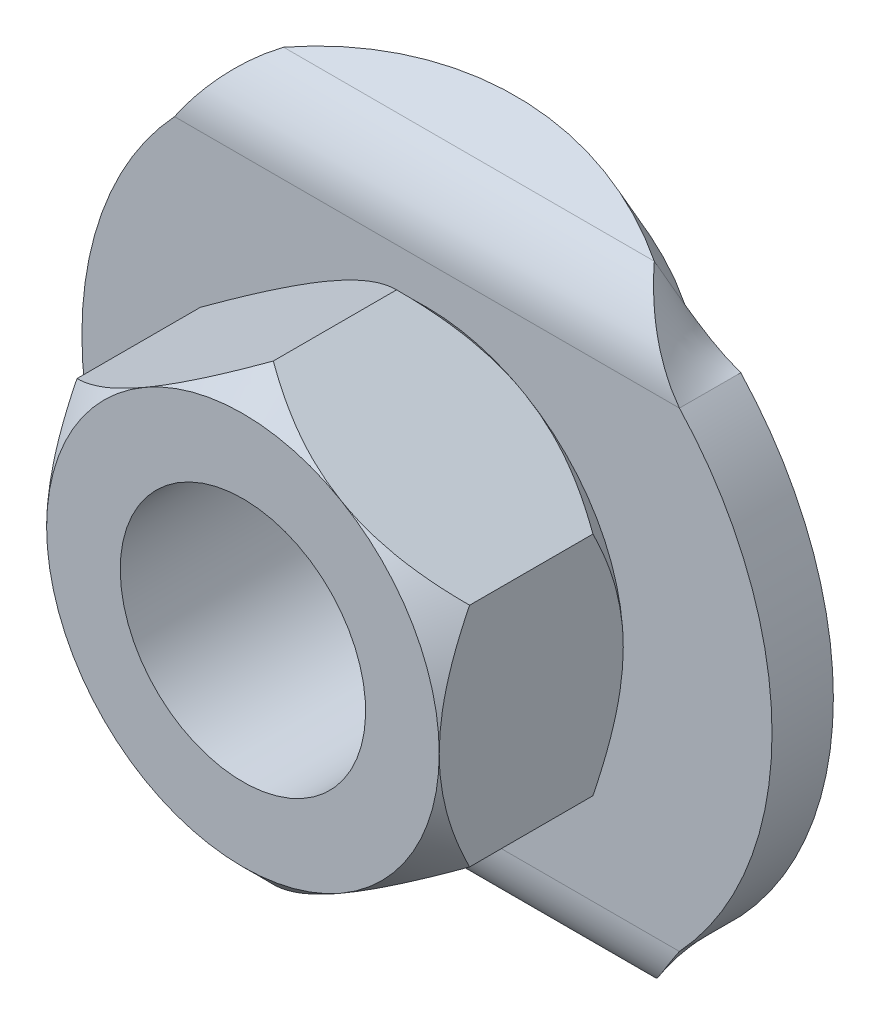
ISO-10303-21;
HEADER;
FILE_DESCRIPTION(('STEP AP214'),'2;1');
FILE_NAME('part.step','',(''),(''),'','','');
FILE_SCHEMA(('AUTOMOTIVE_DESIGN { 1 0 10303 214 1 1 1 1 }'));
ENDSEC;
DATA;
#1=APPLICATION_CONTEXT('core data for automotive mechanical design processes');
#2=APPLICATION_PROTOCOL_DEFINITION('international standard','automotive_design',2000,#1);
#3=PRODUCT_CONTEXT('',#1,'mechanical');
#4=PRODUCT('Part','Part','',(#3));
#5=PRODUCT_RELATED_PRODUCT_CATEGORY('part','',(#4));
#6=PRODUCT_DEFINITION_FORMATION('','',#4);
#7=PRODUCT_DEFINITION_CONTEXT('part definition',#1,'design');
#8=PRODUCT_DEFINITION('design','',#6,#7);
#9=PRODUCT_DEFINITION_SHAPE('','',#8);
#10=(LENGTH_UNIT() NAMED_UNIT(*) SI_UNIT(.MILLI.,.METRE.));
#11=(NAMED_UNIT(*) PLANE_ANGLE_UNIT() SI_UNIT($,.RADIAN.));
#12=(NAMED_UNIT(*) SI_UNIT($,.STERADIAN.) SOLID_ANGLE_UNIT());
#13=UNCERTAINTY_MEASURE_WITH_UNIT(LENGTH_MEASURE(1.E-05),#10,'distance_accuracy_value','');
#14=(GEOMETRIC_REPRESENTATION_CONTEXT(3) GLOBAL_UNCERTAINTY_ASSIGNED_CONTEXT((#13)) GLOBAL_UNIT_ASSIGNED_CONTEXT((#10,
#11,#12)) REPRESENTATION_CONTEXT('',''));
#15=CARTESIAN_POINT('',(0.,0.,0.));
#16=DIRECTION('',(0.,0.,1.));
#17=DIRECTION('',(1.,0.,0.));
#18=AXIS2_PLACEMENT_3D('',#15,#16,#17);
#19=CARTESIAN_POINT('',(0.,0.,7.00397605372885));
#20=DIRECTION('',(0.,0.,-1.));
#21=DIRECTION('',(-0.5,-0.866025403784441,0.));
#22=AXIS2_PLACEMENT_3D('',#19,#20,#21);
#23=CONICAL_SURFACE('',#22,7.39602394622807,0.785398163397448);
#24=CARTESIAN_POINT('',(-6.39999999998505,-3.69504172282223,7.00991655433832));
#25=CARTESIAN_POINT('',(-6.28925599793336,-3.75897980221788,7.07384478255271));
#26=CARTESIAN_POINT('',(-6.17765565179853,-3.82341229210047,7.13579860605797));
#27=CARTESIAN_POINT('',(-5.95256973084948,-3.95336570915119,7.25515410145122));
#28=CARTESIAN_POINT('',(-5.83908310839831,-4.01888724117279,7.31255313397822));
#29=CARTESIAN_POINT('',(-5.49437260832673,-4.21790594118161,7.47755291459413));
#30=CARTESIAN_POINT('',(-5.26020699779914,-4.35310151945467,7.57718369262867));
#31=CARTESIAN_POINT('',(-4.79109462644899,-4.62394367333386,7.74632080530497));
#32=CARTESIAN_POINT('',(-4.55636836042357,-4.75946294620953,7.81661849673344));
#33=CARTESIAN_POINT('',(-4.20052762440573,-4.96490769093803,7.89794625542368));
#34=CARTESIAN_POINT('',(-4.0814370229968,-5.03366468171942,7.92102214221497));
#35=CARTESIAN_POINT('',(-3.84226113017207,-5.1717529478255,7.95862409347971));
#36=CARTESIAN_POINT('',(-3.72217616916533,-5.24108403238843,7.97315289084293));
#37=CARTESIAN_POINT('',(-3.53509969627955,-5.34909268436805,7.9887749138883));
#38=CARTESIAN_POINT('',(-3.46829233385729,-5.38766393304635,7.99297018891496));
#39=CARTESIAN_POINT('',(-3.3343254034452,-5.46500977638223,7.99858983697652));
#40=CARTESIAN_POINT('',(-3.26716548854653,-5.50378457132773,8.00000316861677));
#41=CARTESIAN_POINT('',(-3.19999999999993,-5.54256258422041,7.99999999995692));
#42=B_SPLINE_CURVE_WITH_KNOTS('',3,(#24,#25,#26,#27,#28,#29,#30,#31,#32,#33,#34,#35,#36,#37,#38,
#39,#40,#41),.UNSPECIFIED.,.F.,.F.,(4,2,2,2,2,2,2,2,4),(0.,0.428870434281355,0.857987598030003,
1.72130127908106,2.55952433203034,2.97761259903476,3.39556711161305,3.62729196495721,
3.85993468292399),.UNSPECIFIED.);
#43=CARTESIAN_POINT('',(-6.39999999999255,-3.69504172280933,7.00991655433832));
#44=VERTEX_POINT('',#43);
#45=CARTESIAN_POINT('',(-3.19999999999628,-5.5425625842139,7.99999999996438));
#46=VERTEX_POINT('',#45);
#47=EDGE_CURVE('E452',#44,#46,#42,.T.);
#48=ORIENTED_EDGE('',*,*,#47,.T.);
#49=CARTESIAN_POINT('',(0.,0.,7.9999999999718));
#50=DIRECTION('',(0.,0.,-1.));
#51=DIRECTION('',(-0.5,-0.866025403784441,0.));
#52=AXIS2_PLACEMENT_3D('',#49,#50,#51);
#53=CIRCLE('',#52,6.39999999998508);
#54=CARTESIAN_POINT('',(-6.39999999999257,0.,7.99999999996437));
#55=VERTEX_POINT('',#54);
#56=EDGE_CURVE('E402',#55,#46,#53,.F.);
#57=ORIENTED_EDGE('',*,*,#56,.F.);
#58=CARTESIAN_POINT('',(-6.40000000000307,0.,7.99999999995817));
#59=CARTESIAN_POINT('',(-6.40000000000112,-0.0982899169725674,8.00001141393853));
#60=CARTESIAN_POINT('',(-6.40000000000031,-0.196575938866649,7.99773602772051));
#61=CARTESIAN_POINT('',(-6.39999999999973,-0.39292641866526,7.98869643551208));
#62=CARTESIAN_POINT('',(-6.39999999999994,-0.49099090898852,7.98193293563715));
#63=CARTESIAN_POINT('',(-6.4000000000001,-0.686543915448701,7.96401757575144));
#64=CARTESIAN_POINT('',(-6.40000000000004,-0.784033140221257,7.9528734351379));
#65=CARTESIAN_POINT('',(-6.4,-0.978430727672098,7.92635728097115));
#66=CARTESIAN_POINT('',(-6.40000000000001,-1.07533907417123,7.91098515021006));
#67=CARTESIAN_POINT('',(-6.40000000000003,-1.3620356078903,7.85934256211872));
#68=CARTESIAN_POINT('',(-6.40000000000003,-1.55079851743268,7.81725852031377));
#69=CARTESIAN_POINT('',(-6.40000000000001,-1.9247063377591,7.71929042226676));
#70=CARTESIAN_POINT('',(-6.4,-2.10985009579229,7.66340204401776));
#71=CARTESIAN_POINT('',(-6.4,-2.41265138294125,7.56127273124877));
#72=CARTESIAN_POINT('',(-6.40000000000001,-2.53146367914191,7.5183992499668));
#73=CARTESIAN_POINT('',(-6.40000000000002,-2.76734678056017,7.42817545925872));
#74=CARTESIAN_POINT('',(-6.40000000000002,-2.88441794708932,7.38082609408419));
#75=CARTESIAN_POINT('',(-6.40000000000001,-3.11806570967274,7.2816419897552));
#76=CARTESIAN_POINT('',(-6.40000000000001,-3.23462467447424,7.22976593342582));
#77=CARTESIAN_POINT('',(-6.40000000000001,-3.46606944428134,7.12242102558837));
#78=CARTESIAN_POINT('',(-6.40000000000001,-3.58095536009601,7.06695241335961));
#79=CARTESIAN_POINT('',(-6.4,-3.69504172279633,7.00991655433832));
#80=B_SPLINE_CURVE_WITH_KNOTS('',3,(#58,#59,#60,#61,#62,#63,#64,#65,#66,#67,#68,#69,#70,#71,#72,
#73,#74,#75,#76,#77,#78,#79),.UNSPECIFIED.,.F.,.F.,(4,2,2,2,2,2,2,2,2,2,4),(0.,
0.294836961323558,0.589627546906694,0.883900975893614,1.17818256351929,1.7577242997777,
2.33744771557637,2.71629282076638,3.09505818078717,3.47774006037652,3.8603964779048),.UNSPECIFIED.);
#81=EDGE_CURVE('E392',#55,#44,#80,.T.);
#82=ORIENTED_EDGE('',*,*,#81,.T.);
#83=EDGE_LOOP('',(#48,#57,#82));
#84=FACE_BOUND('',#83,.T.);
#85=ADVANCED_FACE('F14',(#84),#23,.T.);
#86=CARTESIAN_POINT('',(0.,0.,7.00397605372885));
#87=DIRECTION('',(0.,0.,-1.));
#88=DIRECTION('',(-0.5,-0.866025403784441,0.));
#89=AXIS2_PLACEMENT_3D('',#86,#87,#88);
#90=CONICAL_SURFACE('',#89,7.39602394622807,0.785398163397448);
#91=CARTESIAN_POINT('',(1.49280147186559E-11,-7.3900834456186,7.0099165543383));
#92=CARTESIAN_POINT('',(0.110744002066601,-7.32614536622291,7.07384478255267));
#93=CARTESIAN_POINT('',(0.222344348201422,-7.2617128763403,7.13579860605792));
#94=CARTESIAN_POINT('',(0.44743026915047,-7.13175945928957,7.25515410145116));
#95=CARTESIAN_POINT('',(0.560916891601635,-7.06623792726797,7.31255313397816));
#96=CARTESIAN_POINT('',(0.905627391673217,-6.86721922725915,7.47755291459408));
#97=CARTESIAN_POINT('',(1.13979300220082,-6.73202364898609,7.57718369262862));
#98=CARTESIAN_POINT('',(1.60890537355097,-6.46118149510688,7.74632080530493));
#99=CARTESIAN_POINT('',(1.8436316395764,-6.32566222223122,7.8166184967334));
#100=CARTESIAN_POINT('',(2.19947237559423,-6.12021747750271,7.89794625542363));
#101=CARTESIAN_POINT('',(2.31856297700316,-6.05146048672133,7.92102214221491));
#102=CARTESIAN_POINT('',(2.55773886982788,-5.91337222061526,7.95862409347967));
#103=CARTESIAN_POINT('',(2.67782383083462,-5.84404113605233,7.97315289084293));
#104=CARTESIAN_POINT('',(2.8649003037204,-5.7360324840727,7.98877491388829));
#105=CARTESIAN_POINT('',(2.93170766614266,-5.6974612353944,7.99297018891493));
#106=CARTESIAN_POINT('',(3.06567459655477,-5.62011539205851,7.99858983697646));
#107=CARTESIAN_POINT('',(3.13283451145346,-5.58134059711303,8.00000316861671));
#108=CARTESIAN_POINT('',(3.20000000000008,-5.54256258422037,7.99999999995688));
#109=B_SPLINE_CURVE_WITH_KNOTS('',3,(#91,#92,#93,#94,#95,#96,#97,#98,#99,#100,#101,#102,#103,
#104,#105,#106,#107,#108),.UNSPECIFIED.,.F.,.F.,(4,2,2,2,2,2,2,2,4),(0.,0.428870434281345,
0.857987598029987,1.72130127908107,2.55952433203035,2.97761259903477,3.39556711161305,
3.62729196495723,3.85993468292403),.UNSPECIFIED.);
#110=CARTESIAN_POINT('',(0.,-7.3900834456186,7.0099165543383));
#111=VERTEX_POINT('',#110);
#112=CARTESIAN_POINT('',(3.19999999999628,-5.54256258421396,7.99999999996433));
#113=VERTEX_POINT('',#112);
#114=EDGE_CURVE('E466',#111,#113,#109,.T.);
#115=ORIENTED_EDGE('',*,*,#114,.T.);
#116=CARTESIAN_POINT('',(0.,0.,7.9999999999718));
#117=DIRECTION('',(0.,0.,-1.));
#118=DIRECTION('',(-0.5,-0.866025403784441,0.));
#119=AXIS2_PLACEMENT_3D('',#116,#117,#118);
#120=CIRCLE('',#119,6.39999999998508);
#121=EDGE_CURVE('E400',#46,#113,#120,.F.);
#122=ORIENTED_EDGE('',*,*,#121,.F.);
#123=CARTESIAN_POINT('',(-3.20000000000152,-5.542562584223,7.99999999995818));
#124=CARTESIAN_POINT('',(-3.11487843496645,-5.59170754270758,8.00001141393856));
#125=CARTESIAN_POINT('',(-3.02976024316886,-5.64085055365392,7.99773602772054));
#126=CARTESIAN_POINT('',(-2.8597157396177,-5.73902579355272,7.98869643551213));
#127=CARTESIAN_POINT('',(-2.77478939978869,-5.78805803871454,7.98193293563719));
#128=CARTESIAN_POINT('',(-2.60543552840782,-5.88583454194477,7.96401757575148));
#129=CARTESIAN_POINT('',(-2.52100738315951,-5.934579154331,7.95287343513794));
#130=CARTESIAN_POINT('',(-2.35265413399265,-6.03177794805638,7.92635728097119));
#131=CARTESIAN_POINT('',(-2.26872904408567,-6.08023212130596,7.9109851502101));
#132=CARTESIAN_POINT('',(-2.02044256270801,-6.22358038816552,7.85934256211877));
#133=CARTESIAN_POINT('',(-1.85696908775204,-6.31796184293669,7.81725852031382));
#134=CARTESIAN_POINT('',(-1.5331554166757,-6.50491575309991,7.71929042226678));
#135=CARTESIAN_POINT('',(-1.37281621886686,-6.59748763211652,7.66340204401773));
#136=CARTESIAN_POINT('',(-1.11058261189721,-6.748888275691,7.56127273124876));
#137=CARTESIAN_POINT('',(-1.00768814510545,-6.80829442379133,7.51839924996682));
#138=CARTESIAN_POINT('',(-0.803407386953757,-6.92623597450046,7.42817545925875));
#139=CARTESIAN_POINT('',(-0.70202078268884,-6.98477155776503,7.38082609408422));
#140=CARTESIAN_POINT('',(-0.499675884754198,-7.10159543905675,7.28164198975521));
#141=CARTESIAN_POINT('',(-0.398732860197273,-7.1598749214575,7.22976593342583));
#142=CARTESIAN_POINT('',(-0.198295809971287,-7.27559730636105,7.12242102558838));
#143=CARTESIAN_POINT('',(-0.0988016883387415,-7.33304026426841,7.06695241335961));
#144=CARTESIAN_POINT('',(-1.49231068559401E-11,-7.3900834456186,7.0099165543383));
#145=B_SPLINE_CURVE_WITH_KNOTS('',3,(#123,#124,#125,#126,#127,#128,#129,#130,#131,#132,#133,
#134,#135,#136,#137,#138,#139,#140,#141,#142,#143,#144),.UNSPECIFIED.,.F.,.F.,(4,2,2,2,2,2,2,2,
2,2,4),(0.,0.294836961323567,0.589627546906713,0.883900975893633,1.17818256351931,
1.75772429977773,2.33744771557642,2.71629282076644,3.09505818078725,3.47774006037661,
3.8603964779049),.UNSPECIFIED.);
#146=EDGE_CURVE('E460',#46,#111,#145,.T.);
#147=ORIENTED_EDGE('',*,*,#146,.T.);
#148=EDGE_LOOP('',(#115,#122,#147));
#149=FACE_BOUND('',#148,.T.);
#150=ADVANCED_FACE('F465',(#149),#90,.T.);
#151=CARTESIAN_POINT('',(0.,0.,7.00397605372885));
#152=DIRECTION('',(0.,0.,-1.));
#153=DIRECTION('',(-0.5,-0.866025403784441,0.));
#154=AXIS2_PLACEMENT_3D('',#151,#152,#153);
#155=CONICAL_SURFACE('',#154,7.39602394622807,0.785398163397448);
#156=CARTESIAN_POINT('',(0.,0.,7.9999999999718));
#157=DIRECTION('',(0.,0.,-1.));
#158=DIRECTION('',(-0.5,-0.866025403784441,0.));
#159=AXIS2_PLACEMENT_3D('',#156,#157,#158);
#160=CIRCLE('',#159,6.39999999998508);
#161=CARTESIAN_POINT('',(6.39999999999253,0.,7.99999999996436));
#162=VERTEX_POINT('',#161);
#163=EDGE_CURVE('E398',#113,#162,#160,.F.);
#164=ORIENTED_EDGE('',*,*,#163,.F.);
#165=CARTESIAN_POINT('',(3.20000000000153,-5.54256258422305,7.99999999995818));
#166=CARTESIAN_POINT('',(3.28512156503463,-5.49341762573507,8.00001141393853));
#167=CARTESIAN_POINT('',(3.37023975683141,-5.44427461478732,7.99773602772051));
#168=CARTESIAN_POINT('',(3.54028426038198,-5.3460993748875,7.98869643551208));
#169=CARTESIAN_POINT('',(3.62521060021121,-5.29706712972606,7.98193293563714));
#170=CARTESIAN_POINT('',(3.79456447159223,-5.19929062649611,7.96401757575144));
#171=CARTESIAN_POINT('',(3.87899261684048,-5.15054601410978,7.9528734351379));
#172=CARTESIAN_POINT('',(4.0473458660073,-5.05334722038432,7.92635728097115));
#173=CARTESIAN_POINT('',(4.1312709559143,-5.00489304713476,7.91098515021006));
#174=CARTESIAN_POINT('',(4.37955743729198,-4.86154478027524,7.85934256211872));
#175=CARTESIAN_POINT('',(4.54303091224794,-4.76716332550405,7.81725852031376));
#176=CARTESIAN_POINT('',(4.86684458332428,-4.58020941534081,7.71929042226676));
#177=CARTESIAN_POINT('',(5.02718378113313,-4.48763753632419,7.66340204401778));
#178=CARTESIAN_POINT('',(5.28941738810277,-4.33623689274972,7.56127273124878));
#179=CARTESIAN_POINT('',(5.39231185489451,-4.27683074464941,7.5183992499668));
#180=CARTESIAN_POINT('',(5.59659261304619,-4.1588891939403,7.42817545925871));
#181=CARTESIAN_POINT('',(5.69797921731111,-4.10035361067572,7.38082609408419));
#182=CARTESIAN_POINT('',(5.90032411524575,-3.983529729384,7.28164198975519));
#183=CARTESIAN_POINT('',(6.00126713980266,-3.92525024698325,7.22976593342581));
#184=CARTESIAN_POINT('',(6.20170419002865,-3.80952786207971,7.12242102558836));
#185=CARTESIAN_POINT('',(6.30119831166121,-3.75208490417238,7.0669524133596));
#186=CARTESIAN_POINT('',(6.39999999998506,-3.69504172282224,7.00991655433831));
#187=B_SPLINE_CURVE_WITH_KNOTS('',3,(#165,#166,#167,#168,#169,#170,#171,#172,#173,#174,#175,
#176,#177,#178,#179,#180,#181,#182,#183,#184,#185,#186),.UNSPECIFIED.,.F.,.F.,(4,2,2,2,2,2,2,2,
2,2,4),(0.,0.294836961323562,0.589627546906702,0.883900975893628,1.17818256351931,
1.75772429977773,2.33744771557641,2.71629282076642,3.09505818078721,3.47774006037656,
3.86039647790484),.UNSPECIFIED.);
#188=CARTESIAN_POINT('',(6.39999999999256,-3.69504172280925,7.00991655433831));
#189=VERTEX_POINT('',#188);
#190=EDGE_CURVE('E456',#113,#189,#187,.T.);
#191=ORIENTED_EDGE('',*,*,#190,.T.);
#192=CARTESIAN_POINT('',(6.4,-3.69504172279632,7.00991655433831));
#193=CARTESIAN_POINT('',(6.39999999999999,-3.56716556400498,7.07384478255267));
#194=CARTESIAN_POINT('',(6.39999999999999,-3.43830058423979,7.13579860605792));
#195=CARTESIAN_POINT('',(6.39999999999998,-3.17839375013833,7.25515410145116));
#196=CARTESIAN_POINT('',(6.39999999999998,-3.04735068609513,7.31255313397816));
#197=CARTESIAN_POINT('',(6.39999999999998,-2.64931328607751,7.47755291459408));
#198=CARTESIAN_POINT('',(6.39999999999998,-2.37892212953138,7.57718369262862));
#199=CARTESIAN_POINT('',(6.39999999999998,-1.83723782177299,7.74632080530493));
#200=CARTESIAN_POINT('',(6.39999999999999,-1.56619927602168,7.8166184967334));
#201=CARTESIAN_POINT('',(6.39999999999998,-1.15530978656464,7.89794625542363));
#202=CARTESIAN_POINT('',(6.39999999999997,-1.01779580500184,7.92102214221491));
#203=CARTESIAN_POINT('',(6.39999999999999,-0.741619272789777,7.95862409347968));
#204=CARTESIAN_POINT('',(6.40000000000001,-0.602957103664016,7.97315289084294));
#205=CARTESIAN_POINT('',(6.4,-0.386939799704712,7.9887749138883));
#206=CARTESIAN_POINT('',(6.39999999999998,-0.309797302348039,7.99297018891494));
#207=CARTESIAN_POINT('',(6.39999999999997,-0.155105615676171,7.99858983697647));
#208=CARTESIAN_POINT('',(6.39999999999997,-0.0775560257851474,8.00000316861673));
#209=CARTESIAN_POINT('',(6.4,1.59124957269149E-13,7.99999999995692));
#210=B_SPLINE_CURVE_WITH_KNOTS('',3,(#192,#193,#194,#195,#196,#197,#198,#199,#200,#201,#202,
#203,#204,#205,#206,#207,#208,#209),.UNSPECIFIED.,.F.,.F.,(4,2,2,2,2,2,2,2,4),(0.,
0.428870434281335,0.857987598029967,1.72130127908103,2.55952433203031,2.97761259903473,
3.395567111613,3.62729196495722,3.85993468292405),.UNSPECIFIED.);
#211=EDGE_CURVE('E444',#189,#162,#210,.T.);
#212=ORIENTED_EDGE('',*,*,#211,.T.);
#213=EDGE_LOOP('',(#164,#191,#212));
#214=FACE_BOUND('',#213,.T.);
#215=ADVANCED_FACE('F476',(#214),#155,.T.);
#216=CARTESIAN_POINT('',(0.,0.,7.00397605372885));
#217=DIRECTION('',(0.,0.,-1.));
#218=DIRECTION('',(-0.5,-0.866025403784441,0.));
#219=AXIS2_PLACEMENT_3D('',#216,#217,#218);
#220=CONICAL_SURFACE('',#219,7.39602394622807,0.785398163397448);
#221=CARTESIAN_POINT('',(6.39999999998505,3.69504172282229,7.00991655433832));
#222=CARTESIAN_POINT('',(6.28925599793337,3.75897980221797,7.07384478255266));
#223=CARTESIAN_POINT('',(6.17765565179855,3.82341229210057,7.1357986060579));
#224=CARTESIAN_POINT('',(5.95256973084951,3.9533657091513,7.25515410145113));
#225=CARTESIAN_POINT('',(5.83908310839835,4.01888724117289,7.31255313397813));
#226=CARTESIAN_POINT('',(5.49437260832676,4.21790594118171,7.47755291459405));
#227=CARTESIAN_POINT('',(5.26020699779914,4.35310151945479,7.57718369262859));
#228=CARTESIAN_POINT('',(4.79109462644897,4.62394367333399,7.74632080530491));
#229=CARTESIAN_POINT('',(4.55636836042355,4.75946294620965,7.8166184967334));
#230=CARTESIAN_POINT('',(4.20052762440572,4.96490769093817,7.89794625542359));
#231=CARTESIAN_POINT('',(4.0814370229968,5.03366468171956,7.92102214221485));
#232=CARTESIAN_POINT('',(3.84226113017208,5.1717529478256,7.95862409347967));
#233=CARTESIAN_POINT('',(3.72217616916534,5.24108403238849,7.973152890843));
#234=CARTESIAN_POINT('',(3.53509969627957,5.34909268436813,7.98877491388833));
#235=CARTESIAN_POINT('',(3.46829233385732,5.38766393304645,7.99297018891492));
#236=CARTESIAN_POINT('',(3.33432540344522,5.46500977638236,7.9985898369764));
#237=CARTESIAN_POINT('',(3.26716548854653,5.50378457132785,8.00000316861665));
#238=CARTESIAN_POINT('',(3.1999999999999,5.54256258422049,7.99999999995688));
#239=B_SPLINE_CURVE_WITH_KNOTS('',3,(#221,#222,#223,#224,#225,#226,#227,#228,#229,#230,#231,
#232,#233,#234,#235,#236,#237,#238),.UNSPECIFIED.,.F.,.F.,(4,2,2,2,2,2,2,2,4),(0.,
0.428870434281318,0.857987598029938,1.72130127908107,2.55952433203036,2.97761259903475,
3.395567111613,3.62729196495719,3.85993468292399),.UNSPECIFIED.);
#240=CARTESIAN_POINT('',(6.39999999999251,3.69504172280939,7.00991655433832));
#241=VERTEX_POINT('',#240);
#242=CARTESIAN_POINT('',(3.19999999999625,5.54256258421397,7.99999999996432));
#243=VERTEX_POINT('',#242);
#244=EDGE_CURVE('E416',#241,#243,#239,.T.);
#245=ORIENTED_EDGE('',*,*,#244,.T.);
#246=CARTESIAN_POINT('',(0.,0.,7.9999999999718));
#247=DIRECTION('',(0.,0.,-1.));
#248=DIRECTION('',(-0.5,-0.866025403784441,0.));
#249=AXIS2_PLACEMENT_3D('',#246,#247,#248);
#250=CIRCLE('',#249,6.39999999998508);
#251=EDGE_CURVE('E18',#162,#243,#250,.F.);
#252=ORIENTED_EDGE('',*,*,#251,.F.);
#253=CARTESIAN_POINT('',(6.40000000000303,0.,7.99999999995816));
#254=CARTESIAN_POINT('',(6.40000000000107,0.0982899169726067,8.00001141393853));
#255=CARTESIAN_POINT('',(6.40000000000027,0.19657593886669,7.99773602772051));
#256=CARTESIAN_POINT('',(6.39999999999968,0.392926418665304,7.98869643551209));
#257=CARTESIAN_POINT('',(6.3999999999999,0.490990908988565,7.98193293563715));
#258=CARTESIAN_POINT('',(6.40000000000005,0.686543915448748,7.96401757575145));
#259=CARTESIAN_POINT('',(6.39999999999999,0.784033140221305,7.9528734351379));
#260=CARTESIAN_POINT('',(6.39999999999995,0.978430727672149,7.92635728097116));
#261=CARTESIAN_POINT('',(6.39999999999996,1.07533907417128,7.91098515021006));
#262=CARTESIAN_POINT('',(6.39999999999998,1.36203560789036,7.85934256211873));
#263=CARTESIAN_POINT('',(6.39999999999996,1.55079851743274,7.81725852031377));
#264=CARTESIAN_POINT('',(6.39999999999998,1.92470633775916,7.71929042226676));
#265=CARTESIAN_POINT('',(6.40000000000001,2.10985009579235,7.66340204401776));
#266=CARTESIAN_POINT('',(6.4,2.41265138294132,7.56127273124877));
#267=CARTESIAN_POINT('',(6.39999999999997,2.53146367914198,7.5183992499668));
#268=CARTESIAN_POINT('',(6.39999999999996,2.76734678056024,7.42817545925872));
#269=CARTESIAN_POINT('',(6.39999999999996,2.88441794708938,7.3808260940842));
#270=CARTESIAN_POINT('',(6.39999999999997,3.1180657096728,7.2816419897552));
#271=CARTESIAN_POINT('',(6.39999999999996,3.23462467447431,7.22976593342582));
#272=CARTESIAN_POINT('',(6.39999999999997,3.4660694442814,7.12242102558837));
#273=CARTESIAN_POINT('',(6.39999999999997,3.58095536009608,7.06695241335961));
#274=CARTESIAN_POINT('',(6.4,3.6950417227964,7.00991655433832));
#275=B_SPLINE_CURVE_WITH_KNOTS('',3,(#253,#254,#255,#256,#257,#258,#259,#260,#261,#262,#263,
#264,#265,#266,#267,#268,#269,#270,#271,#272,#273,#274),.UNSPECIFIED.,.F.,.F.,(4,2,2,2,2,2,2,2,
2,2,4),(0.,0.294836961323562,0.589627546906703,0.883900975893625,1.17818256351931,
1.75772429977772,2.3374477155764,2.71629282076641,3.0950581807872,3.47774006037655,
3.86039647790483),.UNSPECIFIED.);
#276=EDGE_CURVE('E420',#162,#241,#275,.T.);
#277=ORIENTED_EDGE('',*,*,#276,.T.);
#278=EDGE_LOOP('',(#245,#252,#277));
#279=FACE_BOUND('',#278,.T.);
#280=ADVANCED_FACE('F418',(#279),#220,.T.);
#281=CARTESIAN_POINT('',(0.,0.,7.00397605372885));
#282=DIRECTION('',(0.,0.,-1.));
#283=DIRECTION('',(-0.5,-0.866025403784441,0.));
#284=AXIS2_PLACEMENT_3D('',#281,#282,#283);
#285=CONICAL_SURFACE('',#284,7.39602394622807,0.785398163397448);
#286=CARTESIAN_POINT('',(-1.49712420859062E-11,7.3900834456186,7.0099165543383));
#287=CARTESIAN_POINT('',(-0.110744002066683,7.32614536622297,7.07384478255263));
#288=CARTESIAN_POINT('',(-0.222344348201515,7.2617128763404,7.13579860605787));
#289=CARTESIAN_POINT('',(-0.44743026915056,7.13175945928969,7.25515410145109));
#290=CARTESIAN_POINT('',(-0.560916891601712,7.06623792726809,7.31255313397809));
#291=CARTESIAN_POINT('',(-0.905627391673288,6.86721922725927,7.47755291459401));
#292=CARTESIAN_POINT('',(-1.13979300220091,6.73202364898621,7.57718369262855));
#293=CARTESIAN_POINT('',(-1.60890537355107,6.46118149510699,7.74632080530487));
#294=CARTESIAN_POINT('',(-1.84363163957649,6.32566222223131,7.81661849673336));
#295=CARTESIAN_POINT('',(-2.19947237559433,6.12021747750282,7.89794625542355));
#296=CARTESIAN_POINT('',(-2.31856297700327,6.05146048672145,7.92102214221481));
#297=CARTESIAN_POINT('',(-2.55773886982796,5.91337222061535,7.95862409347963));
#298=CARTESIAN_POINT('',(-2.67782383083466,5.84404113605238,7.97315289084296));
#299=CARTESIAN_POINT('',(-2.86490030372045,5.73603248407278,7.98877491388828));
#300=CARTESIAN_POINT('',(-2.93170766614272,5.6974612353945,7.99297018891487));
#301=CARTESIAN_POINT('',(-3.06567459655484,5.62011539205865,7.99858983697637));
#302=CARTESIAN_POINT('',(-3.13283451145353,5.58134059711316,8.00000316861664));
#303=CARTESIAN_POINT('',(-3.20000000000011,5.54256258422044,7.99999999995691));
#304=B_SPLINE_CURVE_WITH_KNOTS('',3,(#286,#287,#288,#289,#290,#291,#292,#293,#294,#295,#296,
#297,#298,#299,#300,#301,#302,#303),.UNSPECIFIED.,.F.,.F.,(4,2,2,2,2,2,2,2,4),(0.,
0.428870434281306,0.857987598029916,1.72130127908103,2.55952433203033,2.97761259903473,
3.39556711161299,3.62729196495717,3.85993468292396),.UNSPECIFIED.);
#305=CARTESIAN_POINT('',(-7.51887000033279E-12,7.39008344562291,7.009916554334));
#306=VERTEX_POINT('',#305);
#307=CARTESIAN_POINT('',(-3.19999999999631,5.54256258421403,7.99999999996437));
#308=VERTEX_POINT('',#307);
#309=EDGE_CURVE('E314',#306,#308,#304,.T.);
#310=ORIENTED_EDGE('',*,*,#309,.T.);
#311=CARTESIAN_POINT('',(0.,0.,7.9999999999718));
#312=DIRECTION('',(0.,0.,-1.));
#313=DIRECTION('',(-0.5,-0.866025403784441,0.));
#314=AXIS2_PLACEMENT_3D('',#311,#312,#313);
#315=CIRCLE('',#314,6.39999999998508);
#316=EDGE_CURVE('E405',#243,#308,#315,.F.);
#317=ORIENTED_EDGE('',*,*,#316,.F.);
#318=CARTESIAN_POINT('',(3.20000000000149,5.5425625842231,7.99999999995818));
#319=CARTESIAN_POINT('',(3.11487843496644,5.59170754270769,8.00001141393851));
#320=CARTESIAN_POINT('',(3.02976024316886,5.64085055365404,7.99773602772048));
#321=CARTESIAN_POINT('',(2.85971573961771,5.73902579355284,7.98869643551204));
#322=CARTESIAN_POINT('',(2.7747893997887,5.78805803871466,7.98193293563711));
#323=CARTESIAN_POINT('',(2.60543552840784,5.88583454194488,7.96401757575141));
#324=CARTESIAN_POINT('',(2.52100738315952,5.93457915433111,7.95287343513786));
#325=CARTESIAN_POINT('',(2.35265413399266,6.0317779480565,7.92635728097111));
#326=CARTESIAN_POINT('',(2.26872904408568,6.08023212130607,7.91098515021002));
#327=CARTESIAN_POINT('',(2.02044256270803,6.22358038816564,7.85934256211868));
#328=CARTESIAN_POINT('',(1.85696908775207,6.31796184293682,7.81725852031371));
#329=CARTESIAN_POINT('',(1.5331554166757,6.50491575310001,7.71929042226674));
#330=CARTESIAN_POINT('',(1.37281621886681,6.59748763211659,7.66340204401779));
#331=CARTESIAN_POINT('',(1.11058261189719,6.74888827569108,7.56127273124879));
#332=CARTESIAN_POINT('',(1.00768814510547,6.80829442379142,7.51839924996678));
#333=CARTESIAN_POINT('',(0.803407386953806,6.92623597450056,7.42817545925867));
#334=CARTESIAN_POINT('',(0.702020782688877,6.98477155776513,7.38082609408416));
#335=CARTESIAN_POINT('',(0.49967588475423,7.10159543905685,7.28164198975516));
#336=CARTESIAN_POINT('',(0.398732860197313,7.1598749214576,7.22976593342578));
#337=CARTESIAN_POINT('',(0.198295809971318,7.27559730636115,7.12242102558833));
#338=CARTESIAN_POINT('',(0.098801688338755,7.33304026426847,7.06695241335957));
#339=CARTESIAN_POINT('',(1.48798794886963E-11,7.3900834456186,7.0099165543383));
#340=B_SPLINE_CURVE_WITH_KNOTS('',3,(#318,#319,#320,#321,#322,#323,#324,#325,#326,#327,#328,
#329,#330,#331,#332,#333,#334,#335,#336,#337,#338,#339),.UNSPECIFIED.,.F.,.F.,(4,2,2,2,2,2,2,2,
2,2,4),(0.,0.294836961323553,0.589627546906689,0.883900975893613,1.1781825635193,
1.75772429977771,2.33744771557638,2.7162928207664,3.0950581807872,3.47774006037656,
3.86039647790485),.UNSPECIFIED.);
#341=EDGE_CURVE('E428',#243,#306,#340,.T.);
#342=ORIENTED_EDGE('',*,*,#341,.T.);
#343=EDGE_LOOP('',(#310,#317,#342));
#344=FACE_BOUND('',#343,.T.);
#345=ADVANCED_FACE('F433',(#344),#285,.T.);
#346=CARTESIAN_POINT('',(0.,0.,7.00397605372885));
#347=DIRECTION('',(0.,0.,-1.));
#348=DIRECTION('',(-0.5,-0.866025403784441,0.));
#349=AXIS2_PLACEMENT_3D('',#346,#347,#348);
#350=CONICAL_SURFACE('',#349,7.39602394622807,0.785398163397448);
#351=CARTESIAN_POINT('',(-6.4,3.69504172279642,7.00991655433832));
#352=CARTESIAN_POINT('',(-6.40000000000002,3.56716556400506,7.07384478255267));
#353=CARTESIAN_POINT('',(-6.40000000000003,3.43830058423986,7.13579860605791));
#354=CARTESIAN_POINT('',(-6.40000000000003,3.1783937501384,7.25515410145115));
#355=CARTESIAN_POINT('',(-6.40000000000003,3.0473506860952,7.31255313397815));
#356=CARTESIAN_POINT('',(-6.40000000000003,2.64931328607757,7.47755291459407));
#357=CARTESIAN_POINT('',(-6.40000000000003,2.37892212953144,7.57718369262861));
#358=CARTESIAN_POINT('',(-6.40000000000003,1.83723782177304,7.74632080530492));
#359=CARTESIAN_POINT('',(-6.40000000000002,1.56619927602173,7.8166184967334));
#360=CARTESIAN_POINT('',(-6.40000000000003,1.15530978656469,7.89794625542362));
#361=CARTESIAN_POINT('',(-6.40000000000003,1.0177958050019,7.9210221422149));
#362=CARTESIAN_POINT('',(-6.40000000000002,0.741619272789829,7.95862409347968));
#363=CARTESIAN_POINT('',(-6.39999999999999,0.602957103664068,7.97315289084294));
#364=CARTESIAN_POINT('',(-6.4,0.38693979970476,7.9887749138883));
#365=CARTESIAN_POINT('',(-6.40000000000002,0.309797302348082,7.99297018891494));
#366=CARTESIAN_POINT('',(-6.40000000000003,0.155105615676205,7.99858983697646));
#367=CARTESIAN_POINT('',(-6.40000000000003,0.0775560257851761,8.00000316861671));
#368=CARTESIAN_POINT('',(-6.4,-1.35366184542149E-13,7.99999999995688));
#369=B_SPLINE_CURVE_WITH_KNOTS('',3,(#351,#352,#353,#354,#355,#356,#357,#358,#359,#360,#361,
#362,#363,#364,#365,#366,#367,#368),.UNSPECIFIED.,.F.,.F.,(4,2,2,2,2,2,2,2,4),(0.,
0.428870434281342,0.857987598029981,1.72130127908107,2.55952433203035,2.97761259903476,
3.39556711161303,3.62729196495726,3.85993468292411),.UNSPECIFIED.);
#370=CARTESIAN_POINT('',(-6.4,3.69504172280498,7.00991655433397));
#371=VERTEX_POINT('',#370);
#372=EDGE_CURVE('E383',#371,#55,#369,.T.);
#373=ORIENTED_EDGE('',*,*,#372,.T.);
#374=CARTESIAN_POINT('',(0.,0.,7.9999999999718));
#375=DIRECTION('',(0.,0.,-1.));
#376=DIRECTION('',(-0.5,-0.866025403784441,0.));
#377=AXIS2_PLACEMENT_3D('',#374,#375,#376);
#378=CIRCLE('',#377,6.39999999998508);
#379=EDGE_CURVE('E404',#308,#55,#378,.F.);
#380=ORIENTED_EDGE('',*,*,#379,.F.);
#381=CARTESIAN_POINT('',(-3.20000000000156,5.54256258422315,7.99999999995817));
#382=CARTESIAN_POINT('',(-3.28512156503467,5.49341762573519,8.00001141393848));
#383=CARTESIAN_POINT('',(-3.37023975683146,5.44427461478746,7.99773602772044));
#384=CARTESIAN_POINT('',(-3.54028426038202,5.34609937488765,7.988696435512));
#385=CARTESIAN_POINT('',(-3.62521060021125,5.2970671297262,7.98193293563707));
#386=CARTESIAN_POINT('',(-3.79456447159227,5.19929062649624,7.96401757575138));
#387=CARTESIAN_POINT('',(-3.87899261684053,5.15054601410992,7.95287343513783));
#388=CARTESIAN_POINT('',(-4.04734586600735,5.05334722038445,7.92635728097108));
#389=CARTESIAN_POINT('',(-4.13127095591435,5.0048930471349,7.91098515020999));
#390=CARTESIAN_POINT('',(-4.37955743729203,4.86154478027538,7.85934256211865));
#391=CARTESIAN_POINT('',(-4.543030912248,4.76716332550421,7.81725852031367));
#392=CARTESIAN_POINT('',(-4.86684458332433,4.58020941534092,7.71929042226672));
#393=CARTESIAN_POINT('',(-5.02718378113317,4.48763753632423,7.6634020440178));
#394=CARTESIAN_POINT('',(-5.28941738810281,4.33623689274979,7.56127273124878));
#395=CARTESIAN_POINT('',(-5.39231185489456,4.27683074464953,7.51839924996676));
#396=CARTESIAN_POINT('',(-5.59659261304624,4.15888919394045,7.42817545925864));
#397=CARTESIAN_POINT('',(-5.69797921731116,4.10035361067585,7.38082609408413));
#398=CARTESIAN_POINT('',(-5.90032411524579,3.98352972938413,7.28164198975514));
#399=CARTESIAN_POINT('',(-6.00126713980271,3.92525024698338,7.22976593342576));
#400=CARTESIAN_POINT('',(-6.2017041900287,3.80952786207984,7.12242102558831));
#401=CARTESIAN_POINT('',(-6.30119831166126,3.75208490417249,7.06695241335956));
#402=CARTESIAN_POINT('',(-6.3999999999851,3.6950417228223,7.00991655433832));
#403=B_SPLINE_CURVE_WITH_KNOTS('',3,(#381,#382,#383,#384,#385,#386,#387,#388,#389,#390,#391,
#392,#393,#394,#395,#396,#397,#398,#399,#400,#401,#402),.UNSPECIFIED.,.F.,.F.,(4,2,2,2,2,2,2,2,
2,2,4),(0.,0.294836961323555,0.589627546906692,0.883900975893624,1.17818256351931,
1.75772429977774,2.33744771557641,2.71629282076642,3.09505818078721,3.47774006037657,
3.86039647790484),.UNSPECIFIED.);
#404=EDGE_CURVE('E438',#308,#371,#403,.T.);
#405=ORIENTED_EDGE('',*,*,#404,.T.);
#406=EDGE_LOOP('',(#373,#380,#405));
#407=FACE_BOUND('',#406,.T.);
#408=ADVANCED_FACE('F303',(#407),#350,.T.);
#409=CARTESIAN_POINT('',(3.44655424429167,9.37995246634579,8.));
#410=DIRECTION('',(0.5,-0.866025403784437,0.));
#411=DIRECTION('',(0.866025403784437,0.5,0.));
#412=AXIS2_PLACEMENT_3D('',#409,#410,#411);
#413=PLANE('',#412);
#414=DIRECTION('',(0.,0.,1.));
#415=VECTOR('',#414,1.);
#416=CARTESIAN_POINT('',(0.,7.39008344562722,8.));
#417=LINE('',#416,#415);
#418=CARTESIAN_POINT('',(-3.06477927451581E-08,7.39008342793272,2.99008342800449));
#419=VERTEX_POINT('',#418);
#420=EDGE_CURVE('E431',#306,#419,#417,.F.);
#421=ORIENTED_EDGE('',*,*,#420,.T.);
#422=CARTESIAN_POINT('',(-3.2,5.54256258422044,2.00000000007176));
#423=CARTESIAN_POINT('',(-3.11487843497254,5.59170754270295,1.99998858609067));
#424=CARTESIAN_POINT('',(-3.02976024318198,5.64085055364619,2.00226397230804));
#425=CARTESIAN_POINT('',(-2.85971573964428,5.73902579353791,2.01130356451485));
#426=CARTESIAN_POINT('',(-2.77478939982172,5.78805803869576,2.01806706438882));
#427=CARTESIAN_POINT('',(-2.60543552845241,5.88583454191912,2.03598242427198));
#428=CARTESIAN_POINT('',(-2.52100738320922,5.93457915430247,2.04712656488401));
#429=CARTESIAN_POINT('',(-2.35265413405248,6.03177794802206,2.07364271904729));
#430=CARTESIAN_POINT('',(-2.26872904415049,6.08023212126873,2.08901484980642));
#431=CARTESIAN_POINT('',(-2.02044256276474,6.22358038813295,2.14065743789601));
#432=CARTESIAN_POINT('',(-1.85696908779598,6.31796184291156,2.18274147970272));
#433=CARTESIAN_POINT('',(-1.53315541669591,6.50491575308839,2.28070957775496));
#434=CARTESIAN_POINT('',(-1.37281621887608,6.59748763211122,2.33659795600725));
#435=CARTESIAN_POINT('',(-1.11058261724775,6.74888827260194,2.4387272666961));
#436=CARTESIAN_POINT('',(-1.00768815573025,6.80829441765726,2.48160074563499));
#437=CARTESIAN_POINT('',(-0.803407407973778,6.92623596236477,2.5718245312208));
#438=CARTESIAN_POINT('',(-0.702020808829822,6.98477154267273,2.61917389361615));
#439=CARTESIAN_POINT('',(-0.499675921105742,7.10159541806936,2.71835799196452));
#440=CARTESIAN_POINT('',(-0.398732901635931,7.15987489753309,2.77023404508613));
#441=CARTESIAN_POINT('',(-0.198295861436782,7.27559727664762,2.87757894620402));
#442=CARTESIAN_POINT('',(-0.0988017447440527,7.33304023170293,2.93304755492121));
#443=CARTESIAN_POINT('',(-6.12953396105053E-08,7.39008341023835,2.9900834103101));
#444=B_SPLINE_CURVE_WITH_KNOTS('',3,(#422,#423,#424,#425,#426,#427,#428,#429,#430,#431,#432,
#433,#434,#435,#436,#437,#438,#439,#440,#441,#442,#443),.UNSPECIFIED.,.F.,.F.,(4,2,2,2,2,2,2,2,
2,2,4),(0.,0.294836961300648,0.589627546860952,0.883900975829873,1.17818256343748,
1.75772429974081,2.33744771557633,2.71629280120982,3.09505814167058,3.47774000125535,
3.86039639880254),.UNSPECIFIED.);
#445=CARTESIAN_POINT('',(-3.2,5.54256258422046,2.));
#446=VERTEX_POINT('',#445);
#447=EDGE_CURVE('E285',#446,#419,#444,.T.);
#448=ORIENTED_EDGE('',*,*,#447,.F.);
#449=CARTESIAN_POINT('',(-6.39999999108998,3.69504169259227,2.99008346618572));
#450=CARTESIAN_POINT('',(-6.28925600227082,3.75897978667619,2.92615522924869));
#451=CARTESIAN_POINT('',(-6.17765566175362,3.82341228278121,2.86420140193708));
#452=CARTESIAN_POINT('',(-5.95256974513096,3.95336570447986,2.74484590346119));
#453=CARTESIAN_POINT('',(-5.83908312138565,4.01888723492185,2.68744687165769));
#454=CARTESIAN_POINT('',(-5.49437261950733,4.21790593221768,2.522447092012));
#455=CARTESIAN_POINT('',(-5.26020701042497,4.35310151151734,2.42281631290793));
#456=CARTESIAN_POINT('',(-4.79109464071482,4.62394366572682,2.25367919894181));
#457=CARTESIAN_POINT('',(-4.55636837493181,4.75946293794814,2.18338150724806));
#458=CARTESIAN_POINT('',(-4.20052763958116,4.96490768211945,2.10205374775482));
#459=CARTESIAN_POINT('',(-4.08143703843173,5.03366467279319,2.07897786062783));
#460=CARTESIAN_POINT('',(-3.84226114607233,5.17175293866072,2.04137590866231));
#461=CARTESIAN_POINT('',(-3.72217618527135,5.2410840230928,2.02684711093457));
#462=CARTESIAN_POINT('',(-3.53509970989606,5.34909267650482,2.01122508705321));
#463=CARTESIAN_POINT('',(-3.46829234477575,5.38766392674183,2.00702981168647));
#464=CARTESIAN_POINT('',(-3.33432540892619,5.46500977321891,2.00141016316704));
#465=CARTESIAN_POINT('',(-3.26716549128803,5.50378456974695,1.99999683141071));
#466=CARTESIAN_POINT('',(-3.2,5.54256258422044,2.00000000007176));
#467=B_SPLINE_CURVE_WITH_KNOTS('',3,(#449,#450,#451,#452,#453,#454,#455,#456,#457,#458,#459,
#460,#461,#462,#463,#464,#465,#466),.UNSPECIFIED.,.F.,.F.,(4,2,2,2,2,2,2,2,4),(0.,
0.428870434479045,0.857987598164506,1.72130127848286,2.5595243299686,2.97761259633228,
3.3955671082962,3.62729197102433,3.85993469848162),.UNSPECIFIED.);
#468=CARTESIAN_POINT('',(-6.4,3.69504168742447,2.99008342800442));
#469=VERTEX_POINT('',#468);
#470=EDGE_CURVE('E324',#469,#446,#467,.T.);
#471=ORIENTED_EDGE('',*,*,#470,.F.);
#472=DIRECTION('',(0.,0.,1.));
#473=VECTOR('',#472,1.);
#474=CARTESIAN_POINT('',(-6.4,3.69504172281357,8.));
#475=LINE('',#474,#473);
#476=EDGE_CURVE('E435',#371,#469,#475,.F.);
#477=ORIENTED_EDGE('',*,*,#476,.F.);
#478=ORIENTED_EDGE('',*,*,#404,.F.);
#479=ORIENTED_EDGE('',*,*,#309,.F.);
#480=EDGE_LOOP('',(#421,#448,#471,#477,#478,#479));
#481=FACE_BOUND('',#480,.T.);
#482=ADVANCED_FACE('F299',(#481),#413,.F.);
#483=CARTESIAN_POINT('',(-6.4,-7.67477976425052,8.));
#484=DIRECTION('',(1.,0.,0.));
#485=DIRECTION('',(0.,1.,0.));
#486=AXIS2_PLACEMENT_3D('',#483,#484,#485);
#487=PLANE('',#486);
#488=ORIENTED_EDGE('',*,*,#476,.T.);
#489=CARTESIAN_POINT('',(-6.4,0.,2.00000000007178));
#490=CARTESIAN_POINT('',(-6.40000000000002,0.0982899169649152,1.99998858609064));
#491=CARTESIAN_POINT('',(-6.40000000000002,0.196575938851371,2.00226397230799));
#492=CARTESIAN_POINT('',(-6.40000000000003,0.392926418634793,2.01130356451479));
#493=CARTESIAN_POINT('',(-6.40000000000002,0.49099090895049,2.01806706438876));
#494=CARTESIAN_POINT('',(-6.40000000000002,0.686543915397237,2.03598242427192));
#495=CARTESIAN_POINT('',(-6.40000000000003,0.784033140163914,2.04712656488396));
#496=CARTESIAN_POINT('',(-6.40000000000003,0.978430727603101,2.07364271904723));
#497=CARTESIAN_POINT('',(-6.40000000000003,1.07533907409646,2.08901484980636));
#498=CARTESIAN_POINT('',(-6.40000000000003,1.36203560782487,2.14065743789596));
#499=CARTESIAN_POINT('',(-6.40000000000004,1.55079851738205,2.18274147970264));
#500=CARTESIAN_POINT('',(-6.40000000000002,1.92470633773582,2.28070957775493));
#501=CARTESIAN_POINT('',(-6.39999999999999,2.10985009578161,2.33659795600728));
#502=CARTESIAN_POINT('',(-6.4,2.41265137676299,2.43872726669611));
#503=CARTESIAN_POINT('',(-6.40000000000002,2.53146366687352,2.48160074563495));
#504=CARTESIAN_POINT('',(-6.40000000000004,2.76734675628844,2.57182453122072));
#505=CARTESIAN_POINT('',(-6.40000000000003,2.88441791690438,2.61917389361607));
#506=CARTESIAN_POINT('',(-6.40000000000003,3.11806566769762,2.71835799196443));
#507=CARTESIAN_POINT('',(-6.40000000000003,3.23462462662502,2.77023404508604));
#508=CARTESIAN_POINT('',(-6.40000000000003,3.46606938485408,2.8775789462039));
#509=CARTESIAN_POINT('',(-6.40000000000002,3.58095529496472,2.93304755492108));
#510=CARTESIAN_POINT('',(-6.4,3.69504165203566,2.99008341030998));
#511=B_SPLINE_CURVE_WITH_KNOTS('',3,(#489,#490,#491,#492,#493,#494,#495,#496,#497,#498,#499,
#500,#501,#502,#503,#504,#505,#506,#507,#508,#509,#510),.UNSPECIFIED.,.F.,.F.,(4,2,2,2,2,2,2,2,
2,2,4),(0.,0.29483696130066,0.589627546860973,0.883900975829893,1.1781825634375,
1.75772429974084,2.33744771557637,2.71629280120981,3.09505814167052,3.47774000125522,
3.86039639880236),.UNSPECIFIED.);
#512=CARTESIAN_POINT('',(-6.4,0.,2.00000000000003));
#513=VERTEX_POINT('',#512);
#514=EDGE_CURVE('E332',#513,#469,#511,.T.);
#515=ORIENTED_EDGE('',*,*,#514,.F.);
#516=CARTESIAN_POINT('',(-6.39999996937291,-3.69504173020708,2.99008346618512));
#517=CARTESIAN_POINT('',(-6.39999998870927,-3.56716557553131,2.92615522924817));
#518=CARTESIAN_POINT('',(-6.39999999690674,-3.43830059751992,2.8642014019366));
#519=CARTESIAN_POINT('',(-6.40000000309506,-3.17839376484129,2.74484590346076));
#520=CARTESIAN_POINT('',(-6.40000000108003,-3.04735070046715,2.68744687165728));
#521=CARTESIAN_POINT('',(-6.3999999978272,-2.64931330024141,2.52244709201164));
#522=CARTESIAN_POINT('',(-6.39999999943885,-2.37892214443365,2.42281631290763));
#523=CARTESIAN_POINT('',(-6.40000000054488,-1.8372378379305,2.25367919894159));
#524=CARTESIAN_POINT('',(-6.40000000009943,-1.56619929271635,2.18338150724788));
#525=CARTESIAN_POINT('',(-6.39999999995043,-1.15530980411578,2.10205374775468));
#526=CARTESIAN_POINT('',(-6.39999999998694,-1.01779582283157,2.07897786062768));
#527=CARTESIAN_POINT('',(-6.4000000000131,-0.741619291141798,2.04137590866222));
#528=CARTESIAN_POINT('',(-6.40000000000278,-0.602957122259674,2.02684711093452));
#529=CARTESIAN_POINT('',(-6.39999999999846,-0.386939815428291,2.01122508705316));
#530=CARTESIAN_POINT('',(-6.39999999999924,-0.309797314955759,2.00702981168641));
#531=CARTESIAN_POINT('',(-6.4000000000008,-0.155105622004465,2.00141016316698));
#532=CARTESIAN_POINT('',(-6.40000000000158,-0.0775560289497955,1.99999683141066));
#533=CARTESIAN_POINT('',(-6.4,0.,2.00000000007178));
#534=B_SPLINE_CURVE_WITH_KNOTS('',3,(#516,#517,#518,#519,#520,#521,#522,#523,#524,#525,#526,
#527,#528,#529,#530,#531,#532,#533),.UNSPECIFIED.,.F.,.F.,(4,2,2,2,2,2,2,2,4),(0.,
0.428870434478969,0.857987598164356,1.72130127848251,2.55952432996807,2.97761259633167,
3.39556710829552,3.62729197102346,3.85993469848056),.UNSPECIFIED.);
#535=CARTESIAN_POINT('',(-6.3999999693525,-3.69504174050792,2.99008342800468));
#536=VERTEX_POINT('',#535);
#537=EDGE_CURVE('E361',#536,#513,#534,.T.);
#538=ORIENTED_EDGE('',*,*,#537,.F.);
#539=DIRECTION('',(0.,0.,1.));
#540=VECTOR('',#539,1.);
#541=CARTESIAN_POINT('',(-6.4,-3.69504172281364,8.));
#542=LINE('',#541,#540);
#543=EDGE_CURVE('E457',#536,#44,#542,.T.);
#544=ORIENTED_EDGE('',*,*,#543,.T.);
#545=ORIENTED_EDGE('',*,*,#81,.F.);
#546=ORIENTED_EDGE('',*,*,#372,.F.);
#547=EDGE_LOOP('',(#488,#515,#538,#544,#545,#546));
#548=FACE_BOUND('',#547,.T.);
#549=ADVANCED_FACE('F302',(#548),#487,.F.);
#550=CARTESIAN_POINT('',(0.,0.,2.99602394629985));
#551=DIRECTION('',(0.,0.,1.));
#552=DIRECTION('',(0.5,0.866025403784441,0.));
#553=AXIS2_PLACEMENT_3D('',#550,#551,#552);
#554=CONICAL_SURFACE('',#553,7.39602394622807,0.785398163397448);
#555=ORIENTED_EDGE('',*,*,#514,.T.);
#556=ORIENTED_EDGE('',*,*,#470,.T.);
#557=CARTESIAN_POINT('',(0.,0.,2.));
#558=DIRECTION('',(0.,0.,-1.));
#559=DIRECTION('',(-1.,0.,0.));
#560=AXIS2_PLACEMENT_3D('',#557,#558,#559);
#561=CIRCLE('',#560,6.39999999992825);
#562=EDGE_CURVE('E512',#513,#446,#561,.T.);
#563=ORIENTED_EDGE('',*,*,#562,.F.);
#564=EDGE_LOOP('',(#555,#556,#563));
#565=FACE_BOUND('',#564,.T.);
#566=ADVANCED_FACE('F346',(#565),#554,.T.);
#567=CARTESIAN_POINT('',(10.0931084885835,-13.2173423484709,8.));
#568=DIRECTION('',(0.5,0.866025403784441,0.));
#569=DIRECTION('',(-0.866025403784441,0.5,0.));
#570=AXIS2_PLACEMENT_3D('',#567,#568,#569);
#571=PLANE('',#570);
#572=ORIENTED_EDGE('',*,*,#543,.F.);
#573=CARTESIAN_POINT('',(-3.2,-5.54256258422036,2.00000000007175));
#574=CARTESIAN_POINT('',(-3.28512156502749,-5.49341762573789,1.9999885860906));
#575=CARTESIAN_POINT('',(-3.37023975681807,-5.44427461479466,2.00226397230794));
#576=CARTESIAN_POINT('',(-3.54028426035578,-5.34609937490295,2.01130356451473));
#577=CARTESIAN_POINT('',(-3.62521060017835,-5.2970671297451,2.01806706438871));
#578=CARTESIAN_POINT('',(-3.79456447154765,-5.19929062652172,2.03598242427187));
#579=CARTESIAN_POINT('',(-3.87899261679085,-5.15054601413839,2.04712656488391));
#580=CARTESIAN_POINT('',(-4.04734586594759,-5.05334722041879,2.07364271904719));
#581=CARTESIAN_POINT('',(-4.13127095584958,-5.00489304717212,2.08901484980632));
#582=CARTESIAN_POINT('',(-4.37955743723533,-4.86154478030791,2.14065743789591));
#583=CARTESIAN_POINT('',(-4.54303091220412,-4.76716332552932,2.18274147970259));
#584=CARTESIAN_POINT('',(-4.86684458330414,-4.58020941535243,2.2807095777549));
#585=CARTESIAN_POINT('',(-5.0271837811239,-4.48763753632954,2.33659795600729));
#586=CARTESIAN_POINT('',(-5.28941738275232,-4.33623689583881,2.43872726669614));
#587=CARTESIAN_POINT('',(-5.39231184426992,-4.27683075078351,2.48160074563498));
#588=CARTESIAN_POINT('',(-5.59659259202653,-4.15888920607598,2.5718245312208));
#589=CARTESIAN_POINT('',(-5.69797919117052,-4.10035362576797,2.61917389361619));
#590=CARTESIAN_POINT('',(-5.90032407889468,-3.98352975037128,2.71835799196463));
#591=CARTESIAN_POINT('',(-6.00126709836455,-3.92525027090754,2.77023404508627));
#592=CARTESIAN_POINT('',(-6.20170413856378,-3.80952789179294,2.87757894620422));
#593=CARTESIAN_POINT('',(-6.30119825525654,-3.7520849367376,2.93304755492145));
#594=CARTESIAN_POINT('',(-6.39999993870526,-3.6950417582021,2.99008341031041));
#595=B_SPLINE_CURVE_WITH_KNOTS('',3,(#573,#574,#575,#576,#577,#578,#579,#580,#581,#582,#583,
#584,#585,#586,#587,#588,#589,#590,#591,#592,#593,#594),.UNSPECIFIED.,.F.,.F.,(4,2,2,2,2,2,2,2,
2,2,4),(0.,0.294836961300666,0.589627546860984,0.883900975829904,1.17818256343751,
1.75772429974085,2.33744771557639,2.71629280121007,3.09505814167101,3.47774000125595,
3.86039639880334),.UNSPECIFIED.);
#596=CARTESIAN_POINT('',(-3.2,-5.54256258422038,2.));
#597=VERTEX_POINT('',#596);
#598=EDGE_CURVE('E331',#597,#536,#595,.T.);
#599=ORIENTED_EDGE('',*,*,#598,.F.);
#600=CARTESIAN_POINT('',(2.17358699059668E-08,-7.39008342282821,2.9900834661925));
#601=CARTESIAN_POINT('',(-0.110743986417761,-7.32614536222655,2.92615522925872));
#602=CARTESIAN_POINT('',(-0.222344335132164,-7.26171288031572,2.864201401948));
#603=CARTESIAN_POINT('',(-0.447430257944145,-7.13175946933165,2.74484590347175));
#604=CARTESIAN_POINT('',(-0.560916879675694,-7.06623793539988,2.687446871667));
#605=CARTESIAN_POINT('',(-0.905627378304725,-6.86721923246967,2.52244709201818));
#606=CARTESIAN_POINT('',(-1.13979298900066,-6.7320236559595,2.42281631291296));
#607=CARTESIAN_POINT('',(-1.60890535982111,-6.46118150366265,2.25367919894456));
#608=CARTESIAN_POINT('',(-1.843631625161,-6.32566223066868,2.18338150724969));
#609=CARTESIAN_POINT('',(-2.19947236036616,-6.12021748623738,2.1020537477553));
#610=CARTESIAN_POINT('',(-2.31856296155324,-6.05146049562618,2.078977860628));
#611=CARTESIAN_POINT('',(-2.55773885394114,-5.91337222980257,2.04137590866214));
#612=CARTESIAN_POINT('',(-2.67782381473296,-5.84404114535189,2.02684711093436));
#613=CARTESIAN_POINT('',(-2.86490029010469,-5.73603249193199,2.01122508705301));
#614=CARTESIAN_POINT('',(-2.93170765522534,-5.69746124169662,2.00702981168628));
#615=CARTESIAN_POINT('',(-3.06567459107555,-5.62011539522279,2.00141016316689));
#616=CARTESIAN_POINT('',(-3.13283450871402,-5.58134059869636,1.99999683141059));
#617=CARTESIAN_POINT('',(-3.2,-5.54256258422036,2.00000000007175));
#618=B_SPLINE_CURVE_WITH_KNOTS('',3,(#600,#601,#602,#603,#604,#605,#606,#607,#608,#609,#610,
#611,#612,#613,#614,#615,#616,#617),.UNSPECIFIED.,.F.,.F.,(4,2,2,2,2,2,2,2,4),(0.,
0.428870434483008,0.857987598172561,1.72130127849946,2.55952432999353,2.97761259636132,
3.39556710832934,3.6272919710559,3.85993469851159),.UNSPECIFIED.);
#619=CARTESIAN_POINT('',(3.06358204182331E-08,-7.39008342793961,2.99008342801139));
#620=VERTEX_POINT('',#619);
#621=EDGE_CURVE('E532',#620,#597,#618,.T.);
#622=ORIENTED_EDGE('',*,*,#621,.F.);
#623=DIRECTION('',(0.,0.,1.));
#624=VECTOR('',#623,1.);
#625=CARTESIAN_POINT('',(0.,-7.39008344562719,8.));
#626=LINE('',#625,#624);
#627=EDGE_CURVE('E462',#620,#111,#626,.T.);
#628=ORIENTED_EDGE('',*,*,#627,.T.);
#629=ORIENTED_EDGE('',*,*,#146,.F.);
#630=ORIENTED_EDGE('',*,*,#47,.F.);
#631=EDGE_LOOP('',(#572,#599,#622,#628,#629,#630));
#632=FACE_BOUND('',#631,.T.);
#633=ADVANCED_FACE('F349',(#632),#571,.F.);
#634=CARTESIAN_POINT('',(0.,0.,2.99602394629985));
#635=DIRECTION('',(0.,0.,1.));
#636=DIRECTION('',(0.5,0.866025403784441,0.));
#637=AXIS2_PLACEMENT_3D('',#634,#635,#636);
#638=CONICAL_SURFACE('',#637,7.39602394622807,0.785398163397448);
#639=ORIENTED_EDGE('',*,*,#598,.T.);
#640=ORIENTED_EDGE('',*,*,#537,.T.);
#641=CARTESIAN_POINT('',(0.,0.,2.));
#642=DIRECTION('',(0.,0.,-1.));
#643=DIRECTION('',(-1.,0.,0.));
#644=AXIS2_PLACEMENT_3D('',#641,#642,#643);
#645=CIRCLE('',#644,6.39999999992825);
#646=EDGE_CURVE('E519',#597,#513,#645,.T.);
#647=ORIENTED_EDGE('',*,*,#646,.F.);
#648=EDGE_LOOP('',(#639,#640,#647));
#649=FACE_BOUND('',#648,.T.);
#650=ADVANCED_FACE('F351',(#649),#638,.T.);
#651=CARTESIAN_POINT('',(9.8465542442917,-1.7051727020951,8.));
#652=DIRECTION('',(-0.5,0.866025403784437,0.));
#653=DIRECTION('',(-0.866025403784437,-0.5,0.));
#654=AXIS2_PLACEMENT_3D('',#651,#652,#653);
#655=PLANE('',#654);
#656=ORIENTED_EDGE('',*,*,#627,.F.);
#657=CARTESIAN_POINT('',(3.2,-5.54256258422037,2.00000000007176));
#658=CARTESIAN_POINT('',(3.11487843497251,-5.59170754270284,1.9999885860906));
#659=CARTESIAN_POINT('',(3.02976024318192,-5.64085055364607,2.00226397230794));
#660=CARTESIAN_POINT('',(2.85971573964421,-5.73902579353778,2.01130356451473));
#661=CARTESIAN_POINT('',(2.77478939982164,-5.78805803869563,2.01806706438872));
#662=CARTESIAN_POINT('',(2.60543552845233,-5.88583454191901,2.03598242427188));
#663=CARTESIAN_POINT('',(2.52100738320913,-5.93457915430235,2.04712656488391));
#664=CARTESIAN_POINT('',(2.35265413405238,-6.03177794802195,2.07364271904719));
#665=CARTESIAN_POINT('',(2.26872904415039,-6.08023212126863,2.08901484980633));
#666=CARTESIAN_POINT('',(2.02044256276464,-6.22358038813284,2.14065743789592));
#667=CARTESIAN_POINT('',(1.85696908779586,-6.31796184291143,2.18274147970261));
#668=CARTESIAN_POINT('',(1.53315541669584,-6.5049157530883,2.28070957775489));
#669=CARTESIAN_POINT('',(1.37281621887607,-6.59748763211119,2.33659795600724));
#670=CARTESIAN_POINT('',(1.11058261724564,-6.74888827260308,2.43872726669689));
#671=CARTESIAN_POINT('',(1.00768815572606,-6.80829441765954,2.48160074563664));
#672=CARTESIAN_POINT('',(0.803407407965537,-6.92623596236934,2.57182453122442));
#673=CARTESIAN_POINT('',(0.702020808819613,-6.98477154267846,2.61917389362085));
#674=CARTESIAN_POINT('',(0.499675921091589,-7.10159541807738,2.71835799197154));
#675=CARTESIAN_POINT('',(0.398732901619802,-7.15987489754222,2.77023404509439));
#676=CARTESIAN_POINT('',(0.198295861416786,-7.27559727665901,2.87757894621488));
#677=CARTESIAN_POINT('',(0.0988017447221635,-7.33304023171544,2.93304755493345));
#678=CARTESIAN_POINT('',(6.12716200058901E-08,-7.39008341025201,2.99008341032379));
#679=B_SPLINE_CURVE_WITH_KNOTS('',3,(#657,#658,#659,#660,#661,#662,#663,#664,#665,#666,#667,
#668,#669,#670,#671,#672,#673,#674,#675,#676,#677,#678),.UNSPECIFIED.,.F.,.F.,(4,2,2,2,2,2,2,2,
2,2,4),(0.,0.294836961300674,0.589627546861,0.883900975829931,1.17818256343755,1.75772429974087,
2.33744771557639,2.71629280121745,3.09505814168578,3.47774000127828,3.86039639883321),.UNSPECIFIED.);
#680=CARTESIAN_POINT('',(3.19999999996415,-5.54256258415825,2.));
#681=VERTEX_POINT('',#680);
#682=EDGE_CURVE('E368',#681,#620,#679,.T.);
#683=ORIENTED_EDGE('',*,*,#682,.F.);
#684=CARTESIAN_POINT('',(6.39999993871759,-3.69504175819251,2.99008341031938));
#685=CARTESIAN_POINT('',(6.28925593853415,-3.75897983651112,2.92615518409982));
#686=CARTESIAN_POINT('',(6.17765559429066,-3.82341232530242,2.86420136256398));
#687=CARTESIAN_POINT('',(5.95256967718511,-3.9533657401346,2.74484587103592));
#688=CARTESIAN_POINT('',(5.83908305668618,-4.01888727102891,2.68744684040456));
#689=CARTESIAN_POINT('',(5.49437256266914,-4.21790596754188,2.5224470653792));
#690=CARTESIAN_POINT('',(5.26020695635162,-4.35310154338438,2.42281629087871));
#691=CARTESIAN_POINT('',(4.79109459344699,-4.62394369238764,2.25367918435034));
#692=CARTESIAN_POINT('',(4.55636833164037,-4.75946296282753,2.18338149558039));
#693=CARTESIAN_POINT('',(4.20052760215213,-4.96490770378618,2.10205374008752));
#694=CARTESIAN_POINT('',(4.08143700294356,-5.03366469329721,2.07897785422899));
#695=CARTESIAN_POINT('',(3.84226111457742,-5.17175295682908,2.0413759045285));
#696=CARTESIAN_POINT('',(3.72217615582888,-5.24108404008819,2.02684710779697));
#697=CARTESIAN_POINT('',(3.53509968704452,-5.34909268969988,2.01122508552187));
#698=CARTESIAN_POINT('',(3.46829232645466,-5.38766393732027,2.00702981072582));
#699=CARTESIAN_POINT('',(3.33432539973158,-5.46500977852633,2.00141016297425));
#700=CARTESIAN_POINT('',(3.26716548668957,-5.50378457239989,1.99999683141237));
#701=CARTESIAN_POINT('',(3.2,-5.54256258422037,2.00000000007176));
#702=B_SPLINE_CURVE_WITH_KNOTS('',3,(#684,#685,#686,#687,#688,#689,#690,#691,#692,#693,#694,
#695,#696,#697,#698,#699,#700,#701),.UNSPECIFIED.,.F.,.F.,(4,2,2,2,2,2,2,2,4),(0.,
0.428870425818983,0.857987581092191,1.72130124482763,2.55952428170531,2.97761254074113,
3.39556704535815,3.62729189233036,3.85993460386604),.UNSPECIFIED.);
#703=CARTESIAN_POINT('',(6.4,-3.69504172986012,2.99008344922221));
#704=VERTEX_POINT('',#703);
#705=EDGE_CURVE('E534',#704,#681,#702,.T.);
#706=ORIENTED_EDGE('',*,*,#705,.F.);
#707=DIRECTION('',(0.,0.,1.));
#708=VECTOR('',#707,1.);
#709=CARTESIAN_POINT('',(6.4,-3.69504172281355,8.));
#710=LINE('',#709,#708);
#711=EDGE_CURVE('E472',#704,#189,#710,.T.);
#712=ORIENTED_EDGE('',*,*,#711,.T.);
#713=ORIENTED_EDGE('',*,*,#190,.F.);
#714=ORIENTED_EDGE('',*,*,#114,.F.);
#715=EDGE_LOOP('',(#656,#683,#706,#712,#713,#714));
#716=FACE_BOUND('',#715,.T.);
#717=ADVANCED_FACE('F356',(#716),#655,.F.);
#718=CARTESIAN_POINT('',(0.,0.,2.99602394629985));
#719=DIRECTION('',(0.,0.,1.));
#720=DIRECTION('',(0.5,0.866025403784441,0.));
#721=AXIS2_PLACEMENT_3D('',#718,#719,#720);
#722=CONICAL_SURFACE('',#721,7.39602394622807,0.785398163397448);
#723=ORIENTED_EDGE('',*,*,#682,.T.);
#724=ORIENTED_EDGE('',*,*,#621,.T.);
#725=CARTESIAN_POINT('',(0.,0.,2.));
#726=DIRECTION('',(0.,0.,-1.));
#727=DIRECTION('',(-1.,0.,0.));
#728=AXIS2_PLACEMENT_3D('',#725,#726,#727);
#729=CIRCLE('',#728,6.39999999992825);
#730=EDGE_CURVE('E521',#681,#597,#729,.T.);
#731=ORIENTED_EDGE('',*,*,#730,.F.);
#732=EDGE_LOOP('',(#723,#724,#731));
#733=FACE_BOUND('',#732,.T.);
#734=ADVANCED_FACE('F358',(#733),#722,.T.);
#735=CARTESIAN_POINT('',(6.4,-7.67477976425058,8.));
#736=DIRECTION('',(-1.,0.,0.));
#737=DIRECTION('',(0.,-1.,0.));
#738=AXIS2_PLACEMENT_3D('',#735,#736,#737);
#739=PLANE('',#738);
#740=ORIENTED_EDGE('',*,*,#711,.F.);
#741=CARTESIAN_POINT('',(6.4,0.,2.00000000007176));
#742=CARTESIAN_POINT('',(6.39999999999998,-0.0982899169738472,1.99998858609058));
#743=CARTESIAN_POINT('',(6.39999999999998,-0.196575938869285,2.00226397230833));
#744=CARTESIAN_POINT('',(6.39999999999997,-0.392926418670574,2.01130356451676));
#745=CARTESIAN_POINT('',(6.39999999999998,-0.490990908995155,2.01806706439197));
#746=CARTESIAN_POINT('',(6.39999999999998,-0.686543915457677,2.03598242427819));
#747=CARTESIAN_POINT('',(6.39999999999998,-0.784033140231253,2.04712656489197));
#748=CARTESIAN_POINT('',(6.39999999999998,-0.978430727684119,2.07364271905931));
#749=CARTESIAN_POINT('',(6.39999999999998,-1.07533907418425,2.08901484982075));
#750=CARTESIAN_POINT('',(6.39999999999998,-1.36203560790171,2.1406574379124));
#751=CARTESIAN_POINT('',(6.39999999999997,-1.55079851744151,2.18274147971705));
#752=CARTESIAN_POINT('',(6.39999999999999,-1.92470633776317,2.28070957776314));
#753=CARTESIAN_POINT('',(6.4,-2.10985009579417,2.33659795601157));
#754=CARTESIAN_POINT('',(6.4,-2.41265138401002,2.43872726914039));
#755=CARTESIAN_POINT('',(6.39999999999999,-2.53146368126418,2.48160075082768));
#756=CARTESIAN_POINT('',(6.39999999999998,-2.76734678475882,2.57182454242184));
#757=CARTESIAN_POINT('',(6.39999999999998,-2.88441795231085,2.61917390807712));
#758=CARTESIAN_POINT('',(6.39999999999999,-3.11806571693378,2.71835801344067));
#759=CARTESIAN_POINT('',(6.39999999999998,-3.23462468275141,2.77023407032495));
#760=CARTESIAN_POINT('',(6.39999999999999,-3.46606945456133,2.87757897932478));
#761=CARTESIAN_POINT('',(6.39999999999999,-3.58095537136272,2.93304759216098));
#762=CARTESIAN_POINT('',(6.4,-3.69504173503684,2.99008345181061));
#763=B_SPLINE_CURVE_WITH_KNOTS('',3,(#741,#742,#743,#744,#745,#746,#747,#748,#749,#750,#751,
#752,#753,#754,#755,#756,#757,#758,#759,#760,#761,#762),.UNSPECIFIED.,.F.,.F.,(4,2,2,2,2,2,2,2,
2,2,4),(0.,0.294836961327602,0.589627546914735,0.883900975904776,1.1781825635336,
1.7577242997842,2.33744771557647,2.71629282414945,3.09505818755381,3.47774007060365,
3.86039649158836),.UNSPECIFIED.);
#764=CARTESIAN_POINT('',(6.4,0.,2.));
#765=VERTEX_POINT('',#764);
#766=EDGE_CURVE('E535',#765,#704,#763,.T.);
#767=ORIENTED_EDGE('',*,*,#766,.F.);
#768=CARTESIAN_POINT('',(6.39999996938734,3.69504173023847,2.99008346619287));
#769=CARTESIAN_POINT('',(6.39999998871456,3.5671655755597,2.926155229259));
#770=CARTESIAN_POINT('',(6.39999999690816,3.43830059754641,2.86420140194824));
#771=CARTESIAN_POINT('',(6.40000000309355,3.17839376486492,2.74484590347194));
#772=CARTESIAN_POINT('',(6.40000000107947,3.04735070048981,2.68744687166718));
#773=CARTESIAN_POINT('',(6.39999999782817,2.64931330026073,2.52244709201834));
#774=CARTESIAN_POINT('',(6.39999999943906,2.37892214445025,2.42281631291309));
#775=CARTESIAN_POINT('',(6.40000000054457,1.83723783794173,2.25367919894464));
#776=CARTESIAN_POINT('',(6.40000000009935,1.56619929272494,2.18338150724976));
#777=CARTESIAN_POINT('',(6.3999999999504,1.15530980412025,2.10205374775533));
#778=CARTESIAN_POINT('',(6.39999999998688,1.01779582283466,2.07897786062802));
#779=CARTESIAN_POINT('',(6.40000000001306,0.741619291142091,2.04137590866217));
#780=CARTESIAN_POINT('',(6.40000000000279,0.602957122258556,2.0268471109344));
#781=CARTESIAN_POINT('',(6.39999999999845,0.386939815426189,2.01122508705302));
#782=CARTESIAN_POINT('',(6.39999999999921,0.309797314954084,2.00702981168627));
#783=CARTESIAN_POINT('',(6.40000000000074,0.155105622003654,2.00141016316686));
#784=CARTESIAN_POINT('',(6.40000000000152,0.077556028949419,1.99999683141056));
#785=CARTESIAN_POINT('',(6.4,0.,2.00000000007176));
#786=B_SPLINE_CURVE_WITH_KNOTS('',3,(#768,#769,#770,#771,#772,#773,#774,#775,#776,#777,#778,
#779,#780,#781,#782,#783,#784,#785),.UNSPECIFIED.,.F.,.F.,(4,2,2,2,2,2,2,2,4),(0.,
0.42887043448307,0.85798759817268,1.72130127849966,2.5595243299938,2.97761259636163,
3.39556710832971,3.62729197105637,3.85993469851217),.UNSPECIFIED.);
#787=CARTESIAN_POINT('',(6.39999996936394,3.69504174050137,2.99008342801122));
#788=VERTEX_POINT('',#787);
#789=EDGE_CURVE('E292',#788,#765,#786,.T.);
#790=ORIENTED_EDGE('',*,*,#789,.F.);
#791=DIRECTION('',(0.,0.,1.));
#792=VECTOR('',#791,1.);
#793=CARTESIAN_POINT('',(6.4,3.69504172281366,8.));
#794=LINE('',#793,#792);
#795=EDGE_CURVE('E424',#788,#241,#794,.T.);
#796=ORIENTED_EDGE('',*,*,#795,.T.);
#797=ORIENTED_EDGE('',*,*,#276,.F.);
#798=ORIENTED_EDGE('',*,*,#211,.F.);
#799=EDGE_LOOP('',(#740,#767,#790,#796,#797,#798));
#800=FACE_BOUND('',#799,.T.);
#801=ADVANCED_FACE('F308',(#800),#739,.F.);
#802=CARTESIAN_POINT('',(0.,0.,2.99602394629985));
#803=DIRECTION('',(0.,0.,1.));
#804=DIRECTION('',(0.5,0.866025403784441,0.));
#805=AXIS2_PLACEMENT_3D('',#802,#803,#804);
#806=CONICAL_SURFACE('',#805,7.39602394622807,0.785398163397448);
#807=CARTESIAN_POINT('',(0.,0.,2.));
#808=DIRECTION('',(0.,0.,-1.));
#809=DIRECTION('',(-1.,0.,0.));
#810=AXIS2_PLACEMENT_3D('',#807,#808,#809);
#811=CIRCLE('',#810,6.39999999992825);
#812=EDGE_CURVE('E37',#765,#681,#811,.T.);
#813=ORIENTED_EDGE('',*,*,#812,.F.);
#814=ORIENTED_EDGE('',*,*,#766,.T.);
#815=ORIENTED_EDGE('',*,*,#705,.T.);
#816=EDGE_LOOP('',(#813,#814,#815));
#817=FACE_BOUND('',#816,.T.);
#818=ADVANCED_FACE('F551',(#817),#806,.T.);
#819=CARTESIAN_POINT('',(16.4931084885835,-2.13221718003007,8.));
#820=DIRECTION('',(-0.5,-0.866025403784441,0.));
#821=DIRECTION('',(0.,0.,1.));
#822=AXIS2_PLACEMENT_3D('',#819,#820,#821);
#823=PLANE('',#822);
#824=ORIENTED_EDGE('',*,*,#795,.F.);
#825=CARTESIAN_POINT('',(3.2,5.54256258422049,2.00000000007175));
#826=CARTESIAN_POINT('',(3.28512156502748,5.49341762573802,1.99998858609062));
#827=CARTESIAN_POINT('',(3.37023975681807,5.44427461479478,2.00226397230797));
#828=CARTESIAN_POINT('',(3.54028426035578,5.34609937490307,2.01130356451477));
#829=CARTESIAN_POINT('',(3.62521060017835,5.29706712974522,2.01806706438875));
#830=CARTESIAN_POINT('',(3.79456447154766,5.19929062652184,2.0359824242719));
#831=CARTESIAN_POINT('',(3.87899261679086,5.1505460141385,2.04712656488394));
#832=CARTESIAN_POINT('',(4.0473458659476,5.0533472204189,2.07364271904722));
#833=CARTESIAN_POINT('',(4.13127095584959,5.00489304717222,2.08901484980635));
#834=CARTESIAN_POINT('',(4.37955743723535,4.86154478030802,2.14065743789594));
#835=CARTESIAN_POINT('',(4.54303091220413,4.76716332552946,2.18274147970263));
#836=CARTESIAN_POINT('',(4.86684458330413,4.58020941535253,2.28070957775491));
#837=CARTESIAN_POINT('',(5.02718378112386,4.48763753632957,2.33659795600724));
#838=CARTESIAN_POINT('',(5.28941738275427,4.33623689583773,2.43872726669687));
#839=CARTESIAN_POINT('',(5.39231184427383,4.27683075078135,2.48160074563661));
#840=CARTESIAN_POINT('',(5.5965925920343,4.15888920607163,2.57182453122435));
#841=CARTESIAN_POINT('',(5.69797919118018,4.10035362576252,2.61917389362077));
#842=CARTESIAN_POINT('',(5.90032407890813,3.98352975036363,2.71835799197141));
#843=CARTESIAN_POINT('',(6.00126709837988,3.92525027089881,2.77023404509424));
#844=CARTESIAN_POINT('',(6.20170413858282,3.80952789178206,2.87757894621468));
#845=CARTESIAN_POINT('',(6.3011982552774,3.75208493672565,2.93304755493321));
#846=CARTESIAN_POINT('',(6.3999999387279,3.69504175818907,2.99008341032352));
#847=B_SPLINE_CURVE_WITH_KNOTS('',3,(#825,#826,#827,#828,#829,#830,#831,#832,#833,#834,#835,
#836,#837,#838,#839,#840,#841,#842,#843,#844,#845,#846),.UNSPECIFIED.,.F.,.F.,(4,2,2,2,2,2,2,2,
2,2,4),(0.,0.294836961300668,0.589627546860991,0.883900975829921,1.17818256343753,
1.75772429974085,2.33744771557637,2.71629280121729,3.09505814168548,3.47774000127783,
3.86039639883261),.UNSPECIFIED.);
#848=CARTESIAN_POINT('',(3.2,5.54256258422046,2.));
#849=VERTEX_POINT('',#848);
#850=EDGE_CURVE('E865',#849,#788,#847,.T.);
#851=ORIENTED_EDGE('',*,*,#850,.F.);
#852=CARTESIAN_POINT('',(-2.17171902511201E-08,7.3900834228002,2.99008346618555));
#853=CARTESIAN_POINT('',(0.110743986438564,7.32614536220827,2.92615522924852));
#854=CARTESIAN_POINT('',(0.222344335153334,7.26171288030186,2.8642014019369));
#855=CARTESIAN_POINT('',(0.447430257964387,7.13175946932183,2.74484590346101));
#856=CARTESIAN_POINT('',(0.560916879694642,7.06623793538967,2.68744687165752));
#857=CARTESIAN_POINT('',(0.90562737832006,6.86721923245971,2.52244709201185));
#858=CARTESIAN_POINT('',(1.13979298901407,6.73202365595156,2.4228163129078));
#859=CARTESIAN_POINT('',(1.60890535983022,6.46118150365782,2.2536791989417));
#860=CARTESIAN_POINT('',(1.84363162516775,6.32566223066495,2.18338150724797));
#861=CARTESIAN_POINT('',(2.19947236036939,6.1202174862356,2.10205374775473));
#862=CARTESIAN_POINT('',(2.31856296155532,6.0514604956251,2.07897786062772));
#863=CARTESIAN_POINT('',(2.55773885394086,5.91337222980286,2.04137590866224));
#864=CARTESIAN_POINT('',(2.67782381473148,5.84404114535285,2.02684711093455));
#865=CARTESIAN_POINT('',(2.86490029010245,5.73603249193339,2.01122508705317));
#866=CARTESIAN_POINT('',(2.93170765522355,5.69746124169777,2.00702981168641));
#867=CARTESIAN_POINT('',(3.06567459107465,5.62011539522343,2.00141016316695));
#868=CARTESIAN_POINT('',(3.13283450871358,5.58134059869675,1.99999683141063));
#869=CARTESIAN_POINT('',(3.2,5.54256258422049,2.00000000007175));
#870=B_SPLINE_CURVE_WITH_KNOTS('',3,(#852,#853,#854,#855,#856,#857,#858,#859,#860,#861,#862,
#863,#864,#865,#866,#867,#868,#869),.UNSPECIFIED.,.F.,.F.,(4,2,2,2,2,2,2,2,4),(0.,
0.428870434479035,0.857987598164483,1.72130127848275,2.55952432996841,2.97761259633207,
3.39556710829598,3.62729197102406,3.85993469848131),.UNSPECIFIED.);
#871=EDGE_CURVE('E277',#419,#849,#870,.T.);
#872=ORIENTED_EDGE('',*,*,#871,.F.);
#873=ORIENTED_EDGE('',*,*,#420,.F.);
#874=ORIENTED_EDGE('',*,*,#341,.F.);
#875=ORIENTED_EDGE('',*,*,#244,.F.);
#876=EDGE_LOOP('',(#824,#851,#872,#873,#874,#875));
#877=FACE_BOUND('',#876,.T.);
#878=ADVANCED_FACE('F305',(#877),#823,.F.);
#879=CARTESIAN_POINT('',(0.,0.,2.99602394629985));
#880=DIRECTION('',(0.,0.,1.));
#881=DIRECTION('',(0.5,0.866025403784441,0.));
#882=AXIS2_PLACEMENT_3D('',#879,#880,#881);
#883=CONICAL_SURFACE('',#882,7.39602394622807,0.785398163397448);
#884=ORIENTED_EDGE('',*,*,#850,.T.);
#885=ORIENTED_EDGE('',*,*,#789,.T.);
#886=CARTESIAN_POINT('',(0.,0.,2.));
#887=DIRECTION('',(0.,0.,-1.));
#888=DIRECTION('',(-1.,0.,0.));
#889=AXIS2_PLACEMENT_3D('',#886,#887,#888);
#890=CIRCLE('',#889,6.39999999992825);
#891=EDGE_CURVE('E23',#849,#765,#890,.T.);
#892=ORIENTED_EDGE('',*,*,#891,.F.);
#893=EDGE_LOOP('',(#884,#885,#892));
#894=FACE_BOUND('',#893,.T.);
#895=ADVANCED_FACE('F272',(#894),#883,.T.);
#896=CARTESIAN_POINT('',(0.,0.,2.99602394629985));
#897=DIRECTION('',(0.,0.,1.));
#898=DIRECTION('',(0.5,0.866025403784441,0.));
#899=AXIS2_PLACEMENT_3D('',#896,#897,#898);
#900=CONICAL_SURFACE('',#899,7.39602394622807,0.785398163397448);
#901=ORIENTED_EDGE('',*,*,#447,.T.);
#902=ORIENTED_EDGE('',*,*,#871,.T.);
#903=CARTESIAN_POINT('',(0.,0.,2.));
#904=DIRECTION('',(0.,0.,-1.));
#905=DIRECTION('',(-1.,0.,0.));
#906=AXIS2_PLACEMENT_3D('',#903,#904,#905);
#907=CIRCLE('',#906,6.39999999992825);
#908=EDGE_CURVE('E9',#446,#849,#907,.T.);
#909=ORIENTED_EDGE('',*,*,#908,.F.);
#910=EDGE_LOOP('',(#901,#902,#909));
#911=FACE_BOUND('',#910,.T.);
#912=ADVANCED_FACE('F268',(#911),#900,.T.);
#913=CARTESIAN_POINT('',(13.2931084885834,-7.6747797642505,8.));
#914=DIRECTION('',(0.,0.,1.));
#915=DIRECTION('',(0.5,0.866025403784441,0.));
#916=AXIS2_PLACEMENT_3D('',#913,#914,#915);
#917=PLANE('',#916);
#918=ORIENTED_EDGE('',*,*,#121,.T.);
#919=ORIENTED_EDGE('',*,*,#163,.T.);
#920=ORIENTED_EDGE('',*,*,#251,.T.);
#921=ORIENTED_EDGE('',*,*,#316,.T.);
#922=ORIENTED_EDGE('',*,*,#379,.T.);
#923=ORIENTED_EDGE('',*,*,#56,.T.);
#924=EDGE_LOOP('',(#918,#919,#920,#921,#922,#923));
#925=FACE_BOUND('',#924,.T.);
#926=CARTESIAN_POINT('',(0.,0.,8.));
#927=DIRECTION('',(0.,0.,-1.));
#928=DIRECTION('',(-0.5,-0.866025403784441,0.));
#929=AXIS2_PLACEMENT_3D('',#926,#927,#928);
#930=CIRCLE('',#929,4.);
#931=CARTESIAN_POINT('',(-2.00000000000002,-3.46410161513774,8.));
#932=VERTEX_POINT('',#931);
#933=EDGE_CURVE('E423',#932,#932,#930,.T.);
#934=ORIENTED_EDGE('',*,*,#933,.T.);
#935=EDGE_LOOP('',(#934));
#936=FACE_BOUND('',#935,.T.);
#937=ADVANCED_FACE('F266',(#925,#936),#917,.T.);
#938=CARTESIAN_POINT('',(0.,0.,0.));
#939=DIRECTION('',(0.,0.,1.));
#940=DIRECTION('',(0.,-1.,0.));
#941=AXIS2_PLACEMENT_3D('',#938,#939,#940);
#942=CYLINDRICAL_SURFACE('',#941,4.);
#943=ORIENTED_EDGE('',*,*,#933,.F.);
#944=EDGE_LOOP('',(#943));
#945=FACE_BOUND('',#944,.T.);
#946=CARTESIAN_POINT('',(0.,0.,0.));
#947=DIRECTION('',(0.,0.,1.));
#948=DIRECTION('',(-1.,0.,0.));
#949=AXIS2_PLACEMENT_3D('',#946,#947,#948);
#950=CIRCLE('',#949,4.);
#951=CARTESIAN_POINT('',(-4.,0.,0.));
#952=VERTEX_POINT('',#951);
#953=EDGE_CURVE('E892',#952,#952,#950,.T.);
#954=ORIENTED_EDGE('',*,*,#953,.F.);
#955=EDGE_LOOP('',(#954));
#956=FACE_BOUND('',#955,.T.);
#957=ADVANCED_FACE('F262',(#945,#956),#942,.F.);
#958=CARTESIAN_POINT('',(0.,0.,2.));
#959=DIRECTION('',(0.,0.,1.));
#960=DIRECTION('',(1.,0.,0.));
#961=AXIS2_PLACEMENT_3D('',#958,#959,#960);
#962=PLANE('',#961);
#963=ORIENTED_EDGE('',*,*,#646,.T.);
#964=ORIENTED_EDGE('',*,*,#562,.T.);
#965=ORIENTED_EDGE('',*,*,#908,.T.);
#966=ORIENTED_EDGE('',*,*,#891,.T.);
#967=ORIENTED_EDGE('',*,*,#812,.T.);
#968=ORIENTED_EDGE('',*,*,#730,.T.);
#969=EDGE_LOOP('',(#963,#964,#965,#966,#967,#968));
#970=FACE_BOUND('',#969,.T.);
#971=DIRECTION('',(1.,0.,0.));
#972=VECTOR('',#971,1.);
#973=CARTESIAN_POINT('',(0.,7.6700232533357,2.00000000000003));
#974=LINE('',#973,#972);
#975=CARTESIAN_POINT('',(-8.230020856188,7.67002325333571,2.00000000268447));
#976=VERTEX_POINT('',#975);
#977=CARTESIAN_POINT('',(8.23002085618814,7.6700232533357,2.00000000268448));
#978=VERTEX_POINT('',#977);
#979=EDGE_CURVE('E847',#976,#978,#974,.T.);
#980=ORIENTED_EDGE('',*,*,#979,.F.);
#981=CARTESIAN_POINT('',(0.,0.,2.));
#982=DIRECTION('',(0.,0.,1.));
#983=DIRECTION('',(-1.,0.,0.));
#984=AXIS2_PLACEMENT_3D('',#981,#982,#983);
#985=CIRCLE('',#984,11.25);
#986=CARTESIAN_POINT('',(-8.23002085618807,-7.67002325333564,2.00000000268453));
#987=VERTEX_POINT('',#986);
#988=EDGE_CURVE('E837',#987,#976,#985,.F.);
#989=ORIENTED_EDGE('',*,*,#988,.F.);
#990=DIRECTION('',(1.,0.,0.));
#991=VECTOR('',#990,1.);
#992=CARTESIAN_POINT('',(0.,-7.67002325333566,2.00000000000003));
#993=LINE('',#992,#991);
#994=CARTESIAN_POINT('',(8.23002085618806,-7.67002325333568,2.00000000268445));
#995=VERTEX_POINT('',#994);
#996=EDGE_CURVE('E846',#995,#987,#993,.F.);
#997=ORIENTED_EDGE('',*,*,#996,.F.);
#998=CARTESIAN_POINT('',(0.,0.,2.));
#999=DIRECTION('',(0.,0.,1.));
#1000=DIRECTION('',(-1.,0.,0.));
#1001=AXIS2_PLACEMENT_3D('',#998,#999,#1000);
#1002=CIRCLE('',#1001,11.25);
#1003=EDGE_CURVE('E856',#978,#995,#1002,.F.);
#1004=ORIENTED_EDGE('',*,*,#1003,.F.);
#1005=EDGE_LOOP('',(#980,#989,#997,#1004));
#1006=FACE_BOUND('',#1005,.T.);
#1007=ADVANCED_FACE('F252',(#970,#1006),#962,.T.);
#1008=CARTESIAN_POINT('',(0.,3.56364430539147,7.84905697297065));
#1009=DIRECTION('',(0.,-0.86602540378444,-0.5));
#1010=DIRECTION('',(0.,0.5,-0.86602540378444));
#1011=AXIS2_PLACEMENT_3D('',#1008,#1009,#1010);
#1012=PLANE('',#1011);
#1013=CARTESIAN_POINT('',(0.,3.56364431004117,7.84905697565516));
#1014=DIRECTION('',(0.,0.86602540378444,0.5));
#1015=DIRECTION('',(0.,-0.5,0.86602540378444));
#1016=AXIS2_PLACEMENT_3D('',#1013,#1014,#1015);
#1017=CIRCLE('',#1016,11.25);
#1018=CARTESIAN_POINT('',(6.04394125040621,8.30793757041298,-0.368299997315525));
#1019=VERTEX_POINT('',#1018);
#1020=CARTESIAN_POINT('',(-6.04394125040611,8.30793757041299,-0.368299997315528));
#1021=VERTEX_POINT('',#1020);
#1022=EDGE_CURVE('E155',#1019,#1021,#1017,.T.);
#1023=ORIENTED_EDGE('',*,*,#1022,.F.);
#1024=DIRECTION('',(1.,0.,0.));
#1025=VECTOR('',#1024,1.);
#1026=CARTESIAN_POINT('',(-16.6805319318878,8.30793757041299,-0.36829999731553));
#1027=LINE('',#1026,#1025);
#1028=EDGE_CURVE('E164',#1019,#1021,#1027,.F.);
#1029=ORIENTED_EDGE('',*,*,#1028,.T.);
#1030=EDGE_LOOP('',(#1023,#1029));
#1031=FACE_BOUND('',#1030,.T.);
#1032=ADVANCED_FACE('F167',(#1031),#1012,.T.);
#1033=CARTESIAN_POINT('',(0.,-3.56364430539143,7.84905697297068));
#1034=DIRECTION('',(0.,0.86602540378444,-0.5));
#1035=DIRECTION('',(0.,0.5,0.866025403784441));
#1036=AXIS2_PLACEMENT_3D('',#1033,#1034,#1035);
#1037=PLANE('',#1036);
#1038=CARTESIAN_POINT('',(0.,-3.56364431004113,7.84905697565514));
#1039=DIRECTION('',(0.,-0.86602540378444,0.5));
#1040=DIRECTION('',(0.,-0.5,-0.866025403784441));
#1041=AXIS2_PLACEMENT_3D('',#1038,#1039,#1040);
#1042=CIRCLE('',#1041,11.25);
#1043=CARTESIAN_POINT('',(-6.04394125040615,-8.30793757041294,-0.368299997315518));
#1044=VERTEX_POINT('',#1043);
#1045=CARTESIAN_POINT('',(6.04394125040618,-8.30793757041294,-0.368299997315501));
#1046=VERTEX_POINT('',#1045);
#1047=EDGE_CURVE('E897',#1044,#1046,#1042,.T.);
#1048=ORIENTED_EDGE('',*,*,#1047,.F.);
#1049=DIRECTION('',(-1.,0.,0.));
#1050=VECTOR('',#1049,1.);
#1051=CARTESIAN_POINT('',(16.6805319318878,-8.30793757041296,-0.368299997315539));
#1052=LINE('',#1051,#1050);
#1053=EDGE_CURVE('E165',#1044,#1046,#1052,.F.);
#1054=ORIENTED_EDGE('',*,*,#1053,.T.);
#1055=EDGE_LOOP('',(#1048,#1054));
#1056=FACE_BOUND('',#1055,.T.);
#1057=ADVANCED_FACE('F649',(#1056),#1037,.T.);
#1058=CARTESIAN_POINT('',(0.,-3.56364430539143,7.84905697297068));
#1059=DIRECTION('',(0.,-0.86602540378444,0.5));
#1060=DIRECTION('',(0.,-0.5,-0.866025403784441));
#1061=AXIS2_PLACEMENT_3D('',#1058,#1059,#1060);
#1062=CYLINDRICAL_SURFACE('',#1061,11.25);
#1063=DIRECTION('',(0.,-0.86602540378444,0.5));
#1064=VECTOR('',#1063,1.);
#1065=CARTESIAN_POINT('',(6.04394125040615,-9.17396297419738,0.131700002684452));
#1066=LINE('',#1065,#1064);
#1067=CARTESIAN_POINT('',(6.04394125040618,-10.039988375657,0.631700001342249));
#1068=VERTEX_POINT('',#1067);
#1069=EDGE_CURVE('E889',#1046,#1068,#1066,.T.);
#1070=ORIENTED_EDGE('',*,*,#1069,.T.);
#1071=CARTESIAN_POINT('',(0.,-5.29569511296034,8.84905697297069));
#1072=DIRECTION('',(0.,-0.86602540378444,0.5));
#1073=DIRECTION('',(0.,-0.5,-0.866025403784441));
#1074=AXIS2_PLACEMENT_3D('',#1071,#1072,#1073);
#1075=CIRCLE('',#1074,11.25);
#1076=CARTESIAN_POINT('',(-6.04394125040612,-10.039988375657,0.631700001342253));
#1077=VERTEX_POINT('',#1076);
#1078=EDGE_CURVE('E900',#1068,#1077,#1075,.F.);
#1079=ORIENTED_EDGE('',*,*,#1078,.T.);
#1080=DIRECTION('',(0.,0.866025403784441,-0.5));
#1081=VECTOR('',#1080,1.);
#1082=CARTESIAN_POINT('',(-6.04394125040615,-9.17396297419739,0.131700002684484));
#1083=LINE('',#1082,#1081);
#1084=EDGE_CURVE('E186',#1077,#1044,#1083,.T.);
#1085=ORIENTED_EDGE('',*,*,#1084,.T.);
#1086=ORIENTED_EDGE('',*,*,#1047,.T.);
#1087=EDGE_LOOP('',(#1070,#1079,#1085,#1086));
#1088=FACE_BOUND('',#1087,.T.);
#1089=ADVANCED_FACE('F658',(#1088),#1062,.T.);
#1090=CARTESIAN_POINT('',(0.,3.56364430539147,7.84905697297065));
#1091=DIRECTION('',(0.,0.86602540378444,0.5));
#1092=DIRECTION('',(0.,-0.5,0.86602540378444));
#1093=AXIS2_PLACEMENT_3D('',#1090,#1091,#1092);
#1094=CYLINDRICAL_SURFACE('',#1093,11.25);
#1095=DIRECTION('',(0.,0.866025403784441,0.5));
#1096=VECTOR('',#1095,1.);
#1097=CARTESIAN_POINT('',(-6.04394125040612,9.17396297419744,0.131700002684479));
#1098=LINE('',#1097,#1096);
#1099=CARTESIAN_POINT('',(-6.04394125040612,10.039988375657,0.631700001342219));
#1100=VERTEX_POINT('',#1099);
#1101=EDGE_CURVE('E160',#1021,#1100,#1098,.T.);
#1102=ORIENTED_EDGE('',*,*,#1101,.T.);
#1103=CARTESIAN_POINT('',(0.,5.29569511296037,8.84905697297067));
#1104=DIRECTION('',(0.,0.86602540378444,0.5));
#1105=DIRECTION('',(0.,-0.5,0.86602540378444));
#1106=AXIS2_PLACEMENT_3D('',#1103,#1104,#1105);
#1107=CIRCLE('',#1106,11.25);
#1108=CARTESIAN_POINT('',(6.04394125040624,10.039988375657,0.631700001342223));
#1109=VERTEX_POINT('',#1108);
#1110=EDGE_CURVE('E184',#1100,#1109,#1107,.F.);
#1111=ORIENTED_EDGE('',*,*,#1110,.T.);
#1112=DIRECTION('',(0.,-0.866025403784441,-0.5));
#1113=VECTOR('',#1112,1.);
#1114=CARTESIAN_POINT('',(6.04394125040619,9.17396297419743,0.131700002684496));
#1115=LINE('',#1114,#1113);
#1116=EDGE_CURVE('E162',#1109,#1019,#1115,.T.);
#1117=ORIENTED_EDGE('',*,*,#1116,.T.);
#1118=ORIENTED_EDGE('',*,*,#1022,.T.);
#1119=EDGE_LOOP('',(#1102,#1111,#1117,#1118));
#1120=FACE_BOUND('',#1119,.T.);
#1121=ADVANCED_FACE('F157',(#1120),#1094,.T.);
#1122=CARTESIAN_POINT('',(-16.6805319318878,7.6700232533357,-0.736599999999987));
#1123=DIRECTION('',(1.,0.,0.));
#1124=DIRECTION('',(0.,0.,1.));
#1125=AXIS2_PLACEMENT_3D('',#1122,#1123,#1124);
#1126=CYLINDRICAL_SURFACE('',#1125,0.736600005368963);
#1127=CARTESIAN_POINT('',(-8.230020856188,7.67002325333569,5.36897430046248E-09));
#1128=CARTESIAN_POINT('',(-8.17277929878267,7.69282343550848,5.7383504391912E-07));
#1129=CARTESIAN_POINT('',(-8.1154913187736,7.71548739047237,-0.00105952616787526));
#1130=CARTESIAN_POINT('',(-8.00081614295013,7.76035945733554,-0.00521288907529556));
#1131=CARTESIAN_POINT('',(-7.94342895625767,7.78256760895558,-0.00830597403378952));
#1132=CARTESIAN_POINT('',(-7.77125992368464,7.84817606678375,-0.0204910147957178));
#1133=CARTESIAN_POINT('',(-7.65630534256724,7.89062727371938,-0.0324892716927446));
#1134=CARTESIAN_POINT('',(-7.47987132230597,7.95249698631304,-0.0559242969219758));
#1135=CARTESIAN_POINT('',(-7.41857281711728,7.97338786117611,-0.0649901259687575));
#1136=CARTESIAN_POINT('',(-7.29582824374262,8.01390817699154,-0.0848103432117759));
#1137=CARTESIAN_POINT('',(-7.2343821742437,8.03353760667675,-0.0955647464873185));
#1138=CARTESIAN_POINT('',(-7.11129190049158,8.07137069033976,-0.118546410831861));
#1139=CARTESIAN_POINT('',(-7.04964760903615,8.089573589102,-0.130774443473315));
#1140=CARTESIAN_POINT('',(-6.92616936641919,8.12440884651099,-0.15644315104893));
#1141=CARTESIAN_POINT('',(-6.86433541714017,8.14104122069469,-0.169883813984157));
#1142=CARTESIAN_POINT('',(-6.73964053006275,8.17290857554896,-0.197951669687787));
#1143=CARTESIAN_POINT('',(-6.67677704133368,8.18812153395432,-0.212592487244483));
#1144=CARTESIAN_POINT('',(-6.5508241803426,8.21680599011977,-0.242596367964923));
#1145=CARTESIAN_POINT('',(-6.48773480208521,8.23027744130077,-0.25795945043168));
#1146=CARTESIAN_POINT('',(-6.3613487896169,8.2554530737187,-0.289105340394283));
#1147=CARTESIAN_POINT('',(-6.29805229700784,8.26715827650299,-0.304887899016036));
#1148=CARTESIAN_POINT('',(-6.17119854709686,8.28883831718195,-0.336576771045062));
#1149=CARTESIAN_POINT('',(-6.10764130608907,8.29881326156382,-0.352483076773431));
#1150=CARTESIAN_POINT('',(-6.04394125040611,8.30793757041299,-0.368299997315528));
#1151=B_SPLINE_CURVE_WITH_KNOTS('',3,(#1127,#1128,#1129,#1130,#1131,#1132,#1133,#1134,#1135,
#1136,#1137,#1138,#1139,#1140,#1141,#1142,#1143,#1144,#1145,#1146,#1147,#1148,#1149,#1150),
.UNSPECIFIED.,.F.,.F.,(4,2,2,2,2,2,2,2,2,2,2,4),(0.,0.184823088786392,0.36963000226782,
0.73871001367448,0.934859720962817,1.13101118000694,1.32726579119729,1.52351846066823,
1.7224339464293,1.92135475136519,2.12016006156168,2.31895313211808),.UNSPECIFIED.);
#1152=CARTESIAN_POINT('',(-8.23002085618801,7.67002325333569,2.68447584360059E-09));
#1153=VERTEX_POINT('',#1152);
#1154=EDGE_CURVE('E176',#1153,#1021,#1151,.T.);
#1155=ORIENTED_EDGE('',*,*,#1154,.T.);
#1156=ORIENTED_EDGE('',*,*,#1028,.F.);
#1157=CARTESIAN_POINT('',(6.04394125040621,8.30793757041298,-0.368299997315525));
#1158=CARTESIAN_POINT('',(6.15996276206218,8.28750287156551,-0.332835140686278));
#1159=CARTESIAN_POINT('',(6.27597818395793,8.26405298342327,-0.299108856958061));
#1160=CARTESIAN_POINT('',(6.50798953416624,8.21190204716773,-0.235991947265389));
#1161=CARTESIAN_POINT('',(6.62398546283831,8.18320177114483,-0.206600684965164));
#1162=CARTESIAN_POINT('',(6.86329749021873,8.11937231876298,-0.151311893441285));
#1163=CARTESIAN_POINT('',(6.98661406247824,8.08395191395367,-0.125751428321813));
#1164=CARTESIAN_POINT('',(7.23324731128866,8.00916394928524,-0.0812713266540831));
#1165=CARTESIAN_POINT('',(7.35656398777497,7.9697962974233,-0.062351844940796));
#1166=CARTESIAN_POINT('',(7.60489465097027,7.8877646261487,-0.0315376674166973));
#1167=CARTESIAN_POINT('',(7.7299086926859,7.8450627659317,-0.0197429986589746));
#1168=CARTESIAN_POINT('',(7.91743002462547,7.77995744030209,-0.00791490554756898));
#1169=CARTESIAN_POINT('',(7.97994695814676,7.75807673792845,-0.00494952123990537));
#1170=CARTESIAN_POINT('',(8.10498163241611,7.71413903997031,-0.000991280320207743));
#1171=CARTESIAN_POINT('',(8.16749937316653,7.69208204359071,1.56739034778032E-06));
#1172=CARTESIAN_POINT('',(8.23002085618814,7.6700232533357,5.3689784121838E-09));
#1173=B_SPLINE_CURVE_WITH_KNOTS('',3,(#1157,#1158,#1159,#1160,#1161,#1162,#1163,#1164,#1165,
#1166,#1167,#1168,#1169,#1170,#1171,#1172),.UNSPECIFIED.,.F.,.F.,(4,2,2,2,2,2,2,4),(0.,
0.369032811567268,0.738011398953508,1.13025127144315,1.5225002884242,1.92013541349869,
2.11901519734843,2.3178958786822),.UNSPECIFIED.);
#1174=CARTESIAN_POINT('',(8.23002085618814,7.6700232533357,2.684473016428E-09));
#1175=VERTEX_POINT('',#1174);
#1176=EDGE_CURVE('E196',#1019,#1175,#1173,.T.);
#1177=ORIENTED_EDGE('',*,*,#1176,.T.);
#1178=DIRECTION('',(1.,0.,0.));
#1179=VECTOR('',#1178,1.);
#1180=CARTESIAN_POINT('',(0.,7.67002325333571,0.));
#1181=LINE('',#1180,#1179);
#1182=EDGE_CURVE('E180',#1153,#1175,#1181,.T.);
#1183=ORIENTED_EDGE('',*,*,#1182,.F.);
#1184=EDGE_LOOP('',(#1155,#1156,#1177,#1183));
#1185=FACE_BOUND('',#1184,.T.);
#1186=ADVANCED_FACE('F182',(#1185),#1126,.F.);
#1187=CARTESIAN_POINT('',(16.6805319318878,-7.67002325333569,-0.736599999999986));
#1188=DIRECTION('',(-1.,0.,0.));
#1189=DIRECTION('',(0.,0.,-1.));
#1190=AXIS2_PLACEMENT_3D('',#1187,#1188,#1189);
#1191=CYLINDRICAL_SURFACE('',#1190,0.736600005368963);
#1192=CARTESIAN_POINT('',(8.23002085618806,-7.67002325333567,5.36896401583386E-09));
#1193=CARTESIAN_POINT('',(8.17277952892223,-7.69282408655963,5.75662170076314E-07));
#1194=CARTESIAN_POINT('',(8.11549175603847,-7.71548863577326,-0.00105958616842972));
#1195=CARTESIAN_POINT('',(8.00081694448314,-7.76036175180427,-0.00521315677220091));
#1196=CARTESIAN_POINT('',(7.94342991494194,-7.78257035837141,-0.00830638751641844));
#1197=CARTESIAN_POINT('',(7.77126129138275,-7.84817992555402,-0.0204919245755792));
#1198=CARTESIAN_POINT('',(7.65630687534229,-7.8906315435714,-0.0324905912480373));
#1199=CARTESIAN_POINT('',(7.47987299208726,-7.9525015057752,-0.055926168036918));
#1200=CARTESIAN_POINT('',(7.41857451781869,-7.97339239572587,-0.0649921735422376));
#1201=CARTESIAN_POINT('',(7.29582995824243,-8.01391261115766,-0.0848126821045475));
#1202=CARTESIAN_POINT('',(7.23438387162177,-8.03354192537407,-0.095567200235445));
#1203=CARTESIAN_POINT('',(7.11129350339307,-8.07137465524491,-0.118548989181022));
#1204=CARTESIAN_POINT('',(7.04964913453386,-8.08957731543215,-0.130777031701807));
#1205=CARTESIAN_POINT('',(6.92617071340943,-8.1244120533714,-0.156445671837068));
#1206=CARTESIAN_POINT('',(6.86433666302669,-8.14104414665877,-0.169886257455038));
#1207=CARTESIAN_POINT('',(6.7396415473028,-8.17291090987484,-0.197953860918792));
#1208=CARTESIAN_POINT('',(6.67677793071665,-8.18812355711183,-0.212594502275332));
#1209=CARTESIAN_POINT('',(6.55082480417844,-8.21680740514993,-0.242597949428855));
#1210=CARTESIAN_POINT('',(6.48773528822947,-8.23027855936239,-0.257960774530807));
#1211=CARTESIAN_POINT('',(6.36134904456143,-8.25545368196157,-0.289106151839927));
#1212=CARTESIAN_POINT('',(6.29805245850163,-8.26715867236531,-0.304888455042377));
#1213=CARTESIAN_POINT('',(6.17119857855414,-8.28883841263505,-0.336576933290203));
#1214=CARTESIAN_POINT('',(6.10764130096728,-8.29881326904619,-0.352483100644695));
#1215=CARTESIAN_POINT('',(6.04394125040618,-8.30793757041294,-0.368299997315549));
#1216=B_SPLINE_CURVE_WITH_KNOTS('',3,(#1192,#1193,#1194,#1195,#1196,#1197,#1198,#1199,#1200,
#1201,#1202,#1203,#1204,#1205,#1206,#1207,#1208,#1209,#1210,#1211,#1212,#1213,#1214,#1215),
.UNSPECIFIED.,.F.,.F.,(4,2,2,2,2,2,2,2,2,2,2,4),(0.,0.184823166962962,0.369630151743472,
0.73871022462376,0.93485993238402,1.13101139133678,1.32726602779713,1.52351872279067,
1.72243424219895,1.92135508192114,2.1201603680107,2.31895340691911),.UNSPECIFIED.);
#1217=CARTESIAN_POINT('',(8.23002085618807,-7.67002325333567,2.68450719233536E-09));
#1218=VERTEX_POINT('',#1217);
#1219=EDGE_CURVE('E888',#1218,#1046,#1216,.T.);
#1220=ORIENTED_EDGE('',*,*,#1219,.T.);
#1221=ORIENTED_EDGE('',*,*,#1053,.F.);
#1222=CARTESIAN_POINT('',(-6.04394125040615,-8.30793757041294,-0.368299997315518));
#1223=CARTESIAN_POINT('',(-6.15996276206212,-8.28750287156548,-0.332835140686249));
#1224=CARTESIAN_POINT('',(-6.27597818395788,-8.26405298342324,-0.299108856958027));
#1225=CARTESIAN_POINT('',(-6.50798953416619,-8.21190204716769,-0.235991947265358));
#1226=CARTESIAN_POINT('',(-6.62398546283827,-8.18320177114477,-0.206600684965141));
#1227=CARTESIAN_POINT('',(-6.86329749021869,-8.11937231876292,-0.151311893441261));
#1228=CARTESIAN_POINT('',(-6.9866140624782,-8.08395191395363,-0.12575142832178));
#1229=CARTESIAN_POINT('',(-7.23324731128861,-8.00916394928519,-0.0812713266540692));
#1230=CARTESIAN_POINT('',(-7.35656398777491,-7.96979629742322,-0.0623518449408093));
#1231=CARTESIAN_POINT('',(-7.6048946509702,-7.88776462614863,-0.0315376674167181));
#1232=CARTESIAN_POINT('',(-7.72990869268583,-7.84506276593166,-0.0197429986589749));
#1233=CARTESIAN_POINT('',(-7.91743002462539,-7.77995744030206,-0.00791490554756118));
#1234=CARTESIAN_POINT('',(-7.97994695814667,-7.75807673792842,-0.00494952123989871));
#1235=CARTESIAN_POINT('',(-8.10498163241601,-7.71413903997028,-0.000991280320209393));
#1236=CARTESIAN_POINT('',(-8.16749937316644,-7.69208204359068,1.56739033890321E-06));
#1237=CARTESIAN_POINT('',(-8.23002085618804,-7.67002325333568,5.36895990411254E-09));
#1238=B_SPLINE_CURVE_WITH_KNOTS('',3,(#1222,#1223,#1224,#1225,#1226,#1227,#1228,#1229,#1230,
#1231,#1232,#1233,#1234,#1235,#1236,#1237),.UNSPECIFIED.,.F.,.F.,(4,2,2,2,2,2,2,4),(0.,
0.369032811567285,0.738011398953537,1.13025127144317,1.52250028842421,1.92013541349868,
2.1190151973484,2.31789587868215),.UNSPECIFIED.);
#1239=CARTESIAN_POINT('',(-8.23002085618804,-7.67002325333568,2.68451001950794E-09));
#1240=VERTEX_POINT('',#1239);
#1241=EDGE_CURVE('E895',#1044,#1240,#1238,.T.);
#1242=ORIENTED_EDGE('',*,*,#1241,.T.);
#1243=DIRECTION('',(1.,0.,0.));
#1244=VECTOR('',#1243,1.);
#1245=CARTESIAN_POINT('',(0.,-7.67002325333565,0.));
#1246=LINE('',#1245,#1244);
#1247=EDGE_CURVE('E883',#1218,#1240,#1246,.F.);
#1248=ORIENTED_EDGE('',*,*,#1247,.F.);
#1249=EDGE_LOOP('',(#1220,#1221,#1242,#1248));
#1250=FACE_BOUND('',#1249,.T.);
#1251=ADVANCED_FACE('F715',(#1250),#1191,.F.);
#1252=CARTESIAN_POINT('',(8.2300208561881,-7.67002325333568,2.02000000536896));
#1253=CARTESIAN_POINT('',(8.01370939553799,-7.99257027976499,2.02000000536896));
#1254=CARTESIAN_POINT('',(7.80627512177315,-8.29296196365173,1.96339653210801));
#1255=CARTESIAN_POINT('',(7.40798615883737,-8.82568527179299,1.78182792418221));
#1256=CARTESIAN_POINT('',(7.21732726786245,-9.05803017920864,1.65717293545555));
#1257=CARTESIAN_POINT('',(6.85298066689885,-9.45168397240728,1.38056725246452));
#1258=CARTESIAN_POINT('',(6.67929295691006,-9.61329368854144,1.22870597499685));
#1259=CARTESIAN_POINT('',(6.34888871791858,-9.87627846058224,0.928081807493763));
#1260=CARTESIAN_POINT('',(6.19209699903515,-9.97791857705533,0.779208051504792));
#1261=CARTESIAN_POINT('',(6.04394125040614,-10.0573088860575,0.641700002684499));
#1262=CARTESIAN_POINT('',(8.23002085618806,-7.67002325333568,2.00000000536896));
#1263=CARTESIAN_POINT('',(8.01371095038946,-7.99022948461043,2.00000000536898));
#1264=CARTESIAN_POINT('',(7.80627512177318,-8.28844234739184,1.94380720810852));
#1265=CARTESIAN_POINT('',(7.40798615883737,-8.81730058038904,1.76355593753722));
#1266=CARTESIAN_POINT('',(7.21732726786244,-9.04795975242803,1.63980535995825));
#1267=CARTESIAN_POINT('',(6.85298066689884,-9.43875746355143,1.3652065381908));
#1268=CARTESIAN_POINT('',(6.67929295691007,-9.59919465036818,1.21444706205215));
#1269=CARTESIAN_POINT('',(6.34888871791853,-9.86027138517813,0.916004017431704));
#1270=CARTESIAN_POINT('',(6.19209763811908,-9.96117397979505,0.768210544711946));
#1271=CARTESIAN_POINT('',(6.04394125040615,-10.0399883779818,0.631700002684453));
#1272=CARTESIAN_POINT('',(8.23002085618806,-7.67002325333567,5.36896401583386E-09));
#1273=CARTESIAN_POINT('',(8.01386643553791,-7.75614996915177,5.36895165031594E-09));
#1274=CARTESIAN_POINT('',(7.80627512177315,-7.83648072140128,-0.0151251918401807));
#1275=CARTESIAN_POINT('',(7.40798615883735,-7.97883143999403,-0.0636427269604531));
#1276=CARTESIAN_POINT('',(7.21732726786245,-8.04091707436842,-0.0969521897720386));
#1277=CARTESIAN_POINT('',(6.85298066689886,-8.14610657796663,-0.170864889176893));
#1278=CARTESIAN_POINT('',(6.67929295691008,-8.18929083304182,-0.21144423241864));
#1279=CARTESIAN_POINT('',(6.34888871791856,-8.25956384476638,-0.291774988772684));
#1280=CARTESIAN_POINT('',(6.19216154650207,-8.28671425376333,-0.331540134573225));
#1281=CARTESIAN_POINT('',(6.04394125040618,-8.30793757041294,-0.368299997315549));
#1282=CARTESIAN_POINT('',(8.23002085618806,-7.67002325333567,-0.020199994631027));
#1283=CARTESIAN_POINT('',(8.01386800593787,-7.75378576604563,-0.0201999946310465));
#1284=CARTESIAN_POINT('',(7.80627512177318,-7.83191590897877,-0.03491040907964));
#1285=CARTESIAN_POINT('',(7.40798615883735,-7.97036290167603,-0.0820974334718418));
#1286=CARTESIAN_POINT('',(7.21732726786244,-8.03074594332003,-0.114493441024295));
#1287=CARTESIAN_POINT('',(6.85298066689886,-8.13305080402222,-0.18637921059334));
#1288=CARTESIAN_POINT('',(6.67929295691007,-8.17505080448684,-0.225845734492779));
#1289=CARTESIAN_POINT('',(6.34888871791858,-8.24339669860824,-0.303973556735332));
#1290=CARTESIAN_POINT('',(6.19216219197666,-8.26980221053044,-0.342647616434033));
#1291=CARTESIAN_POINT('',(6.04394125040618,-8.29044385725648,-0.378399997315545));
#1292=B_SPLINE_SURFACE_WITH_KNOTS('',1,3,((#1252,#1253,#1254,#1255,#1256,#1257,#1258,#1259,
#1260,#1261),(#1262,#1263,#1264,#1265,#1266,#1267,#1268,#1269,#1270,#1271),(#1272,#1273,#1274,
#1275,#1276,#1277,#1278,#1279,#1280,#1281),(#1282,#1283,#1284,#1285,#1286,#1287,#1288,#1289,
#1290,#1291)),.UNSPECIFIED.,.F.,.F.,.F.,(2,1,1,2),(4,2,2,2,4),(-0.01,0.,1.,1.0101),(0.,0.25,0.5,
0.75,1.),.UNSPECIFIED.);
#1293=DIRECTION('',(0.,0.,1.));
#1294=VECTOR('',#1293,1.);
#1295=CARTESIAN_POINT('',(8.2300208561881,-7.67002325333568,0.));
#1296=LINE('',#1295,#1294);
#1297=EDGE_CURVE('E871',#995,#1218,#1296,.F.);
#1298=CARTESIAN_POINT('',(6.04394125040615,-10.0399883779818,0.631700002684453));
#1299=CARTESIAN_POINT('',(6.10145737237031,-10.0093746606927,0.684756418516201));
#1300=CARTESIAN_POINT('',(6.15816064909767,-9.97657157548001,0.737429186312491));
#1301=CARTESIAN_POINT('',(6.27018378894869,-9.90669418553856,0.841431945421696));
#1302=CARTESIAN_POINT('',(6.32550327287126,-9.8696187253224,0.892761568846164));
#1303=CARTESIAN_POINT('',(6.43497491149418,-9.79131743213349,0.99347751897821));
#1304=CARTESIAN_POINT('',(6.48912696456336,-9.75009123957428,1.04286367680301));
#1305=CARTESIAN_POINT('',(6.59648983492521,-9.66352386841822,1.13933742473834));
#1306=CARTESIAN_POINT('',(6.64969813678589,-9.61817323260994,1.18641933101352));
#1307=CARTESIAN_POINT('',(6.75524106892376,-9.52368750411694,1.27765471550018));
#1308=CARTESIAN_POINT('',(6.80757583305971,-9.47455299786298,1.32180864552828));
#1309=CARTESIAN_POINT('',(6.91146823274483,-9.37273752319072,1.40679546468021));
#1310=CARTESIAN_POINT('',(6.96302593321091,-9.32005685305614,1.44762863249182));
#1311=CARTESIAN_POINT('',(7.09077469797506,-9.18441090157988,1.54497992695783));
#1312=CARTESIAN_POINT('',(7.16651053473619,-9.0993759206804,1.59924214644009));
#1313=CARTESIAN_POINT('',(7.31671969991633,-8.92295738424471,1.69843365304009));
#1314=CARTESIAN_POINT('',(7.39119277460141,-8.83157257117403,1.74336108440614));
#1315=CARTESIAN_POINT('',(7.53873285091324,-8.64387130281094,1.8228829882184));
#1316=CARTESIAN_POINT('',(7.61180369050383,-8.54757217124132,1.85751116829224));
#1317=CARTESIAN_POINT('',(7.75682773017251,-8.35099549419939,1.91590013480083));
#1318=CARTESIAN_POINT('',(7.82878153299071,-8.25072020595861,1.93966699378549));
#1319=CARTESIAN_POINT('',(7.95576228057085,-8.07045441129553,1.97172602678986));
#1320=CARTESIAN_POINT('',(8.01095403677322,-7.99097798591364,1.98229713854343));
#1321=CARTESIAN_POINT('',(8.12085097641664,-7.83106910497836,1.9964377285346));
#1322=CARTESIAN_POINT('',(8.17555614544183,-7.7506366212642,2.00000700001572));
#1323=CARTESIAN_POINT('',(8.23002085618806,-7.67002325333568,2.00000000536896));
#1324=B_SPLINE_CURVE_WITH_KNOTS('',3,(#1298,#1299,#1300,#1301,#1302,#1303,#1304,#1305,#1306,
#1307,#1308,#1309,#1310,#1311,#1312,#1313,#1314,#1315,#1316,#1317,#1318,#1319,#1320,#1321,#1322,
#1323),.UNSPECIFIED.,.F.,.F.,(4,2,2,2,2,2,2,2,2,2,2,2,4),(0.,0.252042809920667,
0.504153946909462,0.756286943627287,1.00901339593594,1.26170075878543,1.51436689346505,
1.89225391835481,2.27021599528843,2.64692710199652,3.02342733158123,3.31518893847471,
3.60695916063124),.UNSPECIFIED.);
#1325=EDGE_CURVE('E878',#1068,#995,#1324,.T.);
#1326=ORIENTED_EDGE('',*,*,#1069,.F.);
#1327=ORIENTED_EDGE('',*,*,#1219,.F.);
#1328=ORIENTED_EDGE('',*,*,#1297,.F.);
#1329=ORIENTED_EDGE('',*,*,#1325,.F.);
#1330=EDGE_LOOP('',(#1326,#1327,#1328,#1329));
#1331=FACE_BOUND('',#1330,.T.);
#1332=ADVANCED_FACE('F709',(#1331),#1292,.F.);
#1333=CARTESIAN_POINT('',(0.,-5.29569511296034,8.84905697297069));
#1334=DIRECTION('',(0.,0.86602540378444,-0.5));
#1335=DIRECTION('',(0.,0.5,0.866025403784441));
#1336=AXIS2_PLACEMENT_3D('',#1333,#1334,#1335);
#1337=PLANE('',#1336);
#1338=ORIENTED_EDGE('',*,*,#1078,.F.);
#1339=DIRECTION('',(-1.,0.,0.));
#1340=VECTOR('',#1339,1.);
#1341=CARTESIAN_POINT('',(16.6805319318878,-10.0399883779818,0.631700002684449));
#1342=LINE('',#1341,#1340);
#1343=EDGE_CURVE('E879',#1077,#1068,#1342,.F.);
#1344=ORIENTED_EDGE('',*,*,#1343,.F.);
#1345=EDGE_LOOP('',(#1338,#1344));
#1346=FACE_BOUND('',#1345,.T.);
#1347=ADVANCED_FACE('F714',(#1346),#1337,.F.);
#1348=CARTESIAN_POINT('',(-6.04394125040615,-10.0573088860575,0.641700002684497));
#1349=CARTESIAN_POINT('',(-6.40841926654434,-9.81666390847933,1.0585093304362));
#1350=CARTESIAN_POINT('',(-6.77263445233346,-9.46498320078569,1.41012690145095));
#1351=CARTESIAN_POINT('',(-7.50132765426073,-8.63166331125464,1.89124436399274));
#1352=CARTESIAN_POINT('',(-7.86554284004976,-8.15131320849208,2.02000000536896));
#1353=CARTESIAN_POINT('',(-8.23002085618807,-7.67002325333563,2.02000000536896));
#1354=CARTESIAN_POINT('',(-6.04394125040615,-10.0399883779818,0.63170000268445));
#1355=CARTESIAN_POINT('',(-6.40841819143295,-9.80108954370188,1.04548492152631));
#1356=CARTESIAN_POINT('',(-6.77263445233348,-9.4519602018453,1.39455172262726));
#1357=CARTESIAN_POINT('',(-7.50132765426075,-8.62468631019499,1.87217852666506));
#1358=CARTESIAN_POINT('',(-7.86554391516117,-8.14782092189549,2.00000000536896));
#1359=CARTESIAN_POINT('',(-8.23002085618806,-7.67002325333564,2.00000000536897));
#1360=CARTESIAN_POINT('',(-6.04394125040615,-8.30793757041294,-0.368299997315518));
#1361=CARTESIAN_POINT('',(-6.40831068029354,-8.24365306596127,-0.256955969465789));
#1362=CARTESIAN_POINT('',(-6.77263445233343,-8.14966030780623,-0.162966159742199));
#1363=CARTESIAN_POINT('',(-7.50132765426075,-7.92698620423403,-0.0344052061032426));
#1364=CARTESIAN_POINT('',(-7.86565142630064,-7.79859226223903,5.36896077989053E-09));
#1365=CARTESIAN_POINT('',(-8.23002085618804,-7.67002325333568,5.36895990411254E-09));
#1366=B_SPLINE_SURFACE_WITH_KNOTS('',1,3,((#1348,#1349,#1350,#1351,#1352,#1353),(#1354,#1355,
#1356,#1357,#1358,#1359),(#1360,#1361,#1362,#1363,#1364,#1365)),.UNSPECIFIED.,.F.,.F.,.F.,(2,1,
2),(4,2,4),(-0.01,0.,1.),(0.,0.5,1.),.UNSPECIFIED.);
#1367=CARTESIAN_POINT('',(-8.23002085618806,-7.67002325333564,2.00000000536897));
#1368=CARTESIAN_POINT('',(-8.15611629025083,-7.76689513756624,2.00002039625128));
#1369=CARTESIAN_POINT('',(-8.08221268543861,-7.86376413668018,1.99485717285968));
#1370=CARTESIAN_POINT('',(-7.93441485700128,-8.05641200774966,1.97431069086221));
#1371=CARTESIAN_POINT('',(-7.8605206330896,-8.15219093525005,1.95892795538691));
#1372=CARTESIAN_POINT('',(-7.71277286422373,-8.34154419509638,1.91809829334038));
#1373=CARTESIAN_POINT('',(-7.63891931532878,-8.43511944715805,1.89265564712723));
#1374=CARTESIAN_POINT('',(-7.49120592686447,-8.61903632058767,1.83200427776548));
#1375=CARTESIAN_POINT('',(-7.41734608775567,-8.70937809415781,1.79679601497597));
#1376=CARTESIAN_POINT('',(-7.26946986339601,-8.8860018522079,1.71692582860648));
#1377=CARTESIAN_POINT('',(-7.19545346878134,-8.97227509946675,1.67224459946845));
#1378=CARTESIAN_POINT('',(-7.04741914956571,-9.13959006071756,1.57397694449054));
#1379=CARTESIAN_POINT('',(-6.973401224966,-9.22063177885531,1.52039052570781));
#1380=CARTESIAN_POINT('',(-6.82547745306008,-9.37646421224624,1.40499413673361));
#1381=CARTESIAN_POINT('',(-6.75157159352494,-9.45126349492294,1.34319574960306));
#1382=CARTESIAN_POINT('',(-6.60379409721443,-9.59386664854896,1.21203739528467));
#1383=CARTESIAN_POINT('',(-6.52992245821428,-9.66167320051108,1.14268034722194));
#1384=CARTESIAN_POINT('',(-6.3873318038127,-9.78507813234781,1.00226008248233));
#1385=CARTESIAN_POINT('',(-6.31861316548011,-9.84119835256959,0.931654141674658));
#1386=CARTESIAN_POINT('',(-6.18124404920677,-9.94615878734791,0.785341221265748));
#1387=CARTESIAN_POINT('',(-6.11259357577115,-9.99500661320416,0.709639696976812));
#1388=CARTESIAN_POINT('',(-6.04394125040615,-10.0399883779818,0.63170000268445));
#1389=B_SPLINE_CURVE_WITH_KNOTS('',3,(#1367,#1368,#1369,#1370,#1371,#1372,#1373,#1374,#1375,
#1376,#1377,#1378,#1379,#1380,#1381,#1382,#1383,#1384,#1385,#1386,#1387,#1388),.UNSPECIFIED.,
.F.,.F.,(4,2,2,2,2,2,2,2,2,2,4),(0.,0.365419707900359,0.730820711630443,1.09606640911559,
1.46129489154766,1.82727497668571,2.19325477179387,2.55872372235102,2.92405202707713,
3.26387159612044,3.60333297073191),.UNSPECIFIED.);
#1390=EDGE_CURVE('E882',#987,#1077,#1389,.T.);
#1391=DIRECTION('',(0.,0.,1.));
#1392=VECTOR('',#1391,1.);
#1393=CARTESIAN_POINT('',(-8.23002085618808,-7.67002325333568,0.));
#1394=LINE('',#1393,#1392);
#1395=EDGE_CURVE('E841',#1240,#987,#1394,.T.);
#1396=ORIENTED_EDGE('',*,*,#1390,.F.);
#1397=ORIENTED_EDGE('',*,*,#1395,.F.);
#1398=ORIENTED_EDGE('',*,*,#1241,.F.);
#1399=ORIENTED_EDGE('',*,*,#1084,.F.);
#1400=EDGE_LOOP('',(#1396,#1397,#1398,#1399));
#1401=FACE_BOUND('',#1400,.T.);
#1402=ADVANCED_FACE('F217',(#1401),#1366,.F.);
#1403=CARTESIAN_POINT('',(0.,0.,0.));
#1404=DIRECTION('',(0.,0.,-1.));
#1405=DIRECTION('',(1.,0.,0.));
#1406=AXIS2_PLACEMENT_3D('',#1403,#1404,#1405);
#1407=PLANE('',#1406);
#1408=ORIENTED_EDGE('',*,*,#953,.T.);
#1409=EDGE_LOOP('',(#1408));
#1410=FACE_BOUND('',#1409,.T.);
#1411=ORIENTED_EDGE('',*,*,#1247,.T.);
#1412=CARTESIAN_POINT('',(0.,0.,5.36899691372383E-09));
#1413=DIRECTION('',(0.,0.,1.));
#1414=DIRECTION('',(-1.,0.,0.));
#1415=AXIS2_PLACEMENT_3D('',#1412,#1413,#1414);
#1416=CIRCLE('',#1415,11.25);
#1417=EDGE_CURVE('E852',#1153,#1240,#1416,.T.);
#1418=ORIENTED_EDGE('',*,*,#1417,.F.);
#1419=ORIENTED_EDGE('',*,*,#1182,.T.);
#1420=CARTESIAN_POINT('',(0.,0.,5.36899691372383E-09));
#1421=DIRECTION('',(0.,0.,1.));
#1422=DIRECTION('',(-1.,0.,0.));
#1423=AXIS2_PLACEMENT_3D('',#1420,#1421,#1422);
#1424=CIRCLE('',#1423,11.25);
#1425=EDGE_CURVE('E237',#1218,#1175,#1424,.T.);
#1426=ORIENTED_EDGE('',*,*,#1425,.F.);
#1427=EDGE_LOOP('',(#1411,#1418,#1419,#1426));
#1428=FACE_BOUND('',#1427,.T.);
#1429=ADVANCED_FACE('F685',(#1410,#1428),#1407,.T.);
#1430=CARTESIAN_POINT('',(6.04394125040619,10.0573088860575,0.641700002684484));
#1431=CARTESIAN_POINT('',(6.40841926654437,9.81666390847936,1.05850933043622));
#1432=CARTESIAN_POINT('',(6.77263445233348,9.46498320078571,1.41012690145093));
#1433=CARTESIAN_POINT('',(7.5013276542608,8.63166331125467,1.89124436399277));
#1434=CARTESIAN_POINT('',(7.8655428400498,8.15131320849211,2.02000000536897));
#1435=CARTESIAN_POINT('',(8.23002085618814,7.67002325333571,2.02000000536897));
#1436=CARTESIAN_POINT('',(6.04394125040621,10.0399883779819,0.63170000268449));
#1437=CARTESIAN_POINT('',(6.40841819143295,9.80108954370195,1.04548492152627));
#1438=CARTESIAN_POINT('',(6.77263445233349,9.45196020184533,1.39455172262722));
#1439=CARTESIAN_POINT('',(7.50132765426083,8.62468631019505,1.87217852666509));
#1440=CARTESIAN_POINT('',(7.8655439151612,8.14782092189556,2.00000000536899));
#1441=CARTESIAN_POINT('',(8.23002085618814,7.6700232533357,2.00000000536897));
#1442=CARTESIAN_POINT('',(6.04394125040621,8.30793757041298,-0.368299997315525));
#1443=CARTESIAN_POINT('',(6.4083106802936,8.24365306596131,-0.256955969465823));
#1444=CARTESIAN_POINT('',(6.7726344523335,8.14966030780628,-0.162966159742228));
#1445=CARTESIAN_POINT('',(7.5013276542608,7.92698620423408,-0.0344052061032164));
#1446=CARTESIAN_POINT('',(7.86565142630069,7.79859226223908,5.36899141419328E-09));
#1447=CARTESIAN_POINT('',(8.23002085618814,7.6700232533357,5.3689784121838E-09));
#1448=B_SPLINE_SURFACE_WITH_KNOTS('',1,3,((#1430,#1431,#1432,#1433,#1434,#1435),(#1436,#1437,
#1438,#1439,#1440,#1441),(#1442,#1443,#1444,#1445,#1446,#1447)),.UNSPECIFIED.,.F.,.F.,.F.,(2,1,
2),(4,2,4),(-0.01,0.,1.),(0.,0.5,1.),.UNSPECIFIED.);
#1449=CARTESIAN_POINT('',(8.23002085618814,7.6700232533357,2.00000000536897));
#1450=CARTESIAN_POINT('',(8.15611629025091,7.7668951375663,2.00002039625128));
#1451=CARTESIAN_POINT('',(8.08221268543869,7.86376413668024,1.99485717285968));
#1452=CARTESIAN_POINT('',(7.93441485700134,8.05641200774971,1.9743106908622));
#1453=CARTESIAN_POINT('',(7.86052063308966,8.1521909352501,1.9589279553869));
#1454=CARTESIAN_POINT('',(7.71277286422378,8.34154419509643,1.91809829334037));
#1455=CARTESIAN_POINT('',(7.63891931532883,8.4351194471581,1.89265564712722));
#1456=CARTESIAN_POINT('',(7.49120592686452,8.61903632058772,1.83200427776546));
#1457=CARTESIAN_POINT('',(7.41734608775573,8.70937809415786,1.79679601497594));
#1458=CARTESIAN_POINT('',(7.26946986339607,8.88600185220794,1.71692582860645));
#1459=CARTESIAN_POINT('',(7.19545346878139,8.97227509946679,1.67224459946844));
#1460=CARTESIAN_POINT('',(7.04741914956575,9.13959006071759,1.57397694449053));
#1461=CARTESIAN_POINT('',(6.97340122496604,9.22063177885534,1.5203905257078));
#1462=CARTESIAN_POINT('',(6.82547745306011,9.37646421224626,1.4049941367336));
#1463=CARTESIAN_POINT('',(6.75157159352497,9.45126349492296,1.34319574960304));
#1464=CARTESIAN_POINT('',(6.60379409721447,9.59386664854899,1.21203739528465));
#1465=CARTESIAN_POINT('',(6.52992245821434,9.66167320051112,1.14268034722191));
#1466=CARTESIAN_POINT('',(6.38733180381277,9.78507813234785,1.00226008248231));
#1467=CARTESIAN_POINT('',(6.31861316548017,9.84119835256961,0.931654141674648));
#1468=CARTESIAN_POINT('',(6.18124404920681,9.94615878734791,0.785341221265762));
#1469=CARTESIAN_POINT('',(6.11259357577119,9.99500661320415,0.70963969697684));
#1470=CARTESIAN_POINT('',(6.04394125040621,10.0399883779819,0.63170000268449));
#1471=B_SPLINE_CURVE_WITH_KNOTS('',3,(#1449,#1450,#1451,#1452,#1453,#1454,#1455,#1456,#1457,
#1458,#1459,#1460,#1461,#1462,#1463,#1464,#1465,#1466,#1467,#1468,#1469,#1470),.UNSPECIFIED.,
.F.,.F.,(4,2,2,2,2,2,2,2,2,2,4),(0.,0.365419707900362,0.730820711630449,1.0960664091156,
1.46129489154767,1.82727497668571,2.19325477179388,2.55872372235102,2.92405202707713,
3.26387159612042,3.60333297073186),.UNSPECIFIED.);
#1472=EDGE_CURVE('E238',#978,#1109,#1471,.T.);
#1473=DIRECTION('',(0.,0.,1.));
#1474=VECTOR('',#1473,1.);
#1475=CARTESIAN_POINT('',(8.23002085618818,7.6700232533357,0.));
#1476=LINE('',#1475,#1474);
#1477=EDGE_CURVE('E872',#1175,#978,#1476,.T.);
#1478=ORIENTED_EDGE('',*,*,#1472,.F.);
#1479=ORIENTED_EDGE('',*,*,#1477,.F.);
#1480=ORIENTED_EDGE('',*,*,#1176,.F.);
#1481=ORIENTED_EDGE('',*,*,#1116,.F.);
#1482=EDGE_LOOP('',(#1478,#1479,#1480,#1481));
#1483=FACE_BOUND('',#1482,.T.);
#1484=ADVANCED_FACE('F212',(#1483),#1448,.F.);
#1485=CARTESIAN_POINT('',(-8.23002085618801,7.67002325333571,2.02000000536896));
#1486=CARTESIAN_POINT('',(-8.01368421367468,7.99259729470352,2.02000000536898));
#1487=CARTESIAN_POINT('',(-7.80623121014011,8.29300850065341,1.96338719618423));
#1488=CARTESIAN_POINT('',(-7.40791715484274,8.82575327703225,1.78179821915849));
#1489=CARTESIAN_POINT('',(-7.21725199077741,9.0581002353,1.65713231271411));
#1490=CARTESIAN_POINT('',(-6.8529053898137,9.45174593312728,1.38051510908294));
#1491=CARTESIAN_POINT('',(-6.67922395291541,9.61334567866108,1.22865320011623));
#1492=CARTESIAN_POINT('',(-6.34884480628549,9.87630614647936,0.92804350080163));
#1493=CARTESIAN_POINT('',(-6.19207189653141,9.97793202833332,0.779184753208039));
#1494=CARTESIAN_POINT('',(-6.04394125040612,10.0573088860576,0.641700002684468));
#1495=CARTESIAN_POINT('',(-8.230020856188,7.67002325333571,2.00000000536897));
#1496=CARTESIAN_POINT('',(-8.01368576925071,7.99025630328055,2.00000000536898));
#1497=CARTESIAN_POINT('',(-7.80623121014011,8.28848854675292,1.94379793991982));
#1498=CARTESIAN_POINT('',(-7.40791715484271,8.81736809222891,1.76352644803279));
#1499=CARTESIAN_POINT('',(-7.21725199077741,9.04802930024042,1.63976503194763));
#1500=CARTESIAN_POINT('',(-6.8529053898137,9.43881897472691,1.36515477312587));
#1501=CARTESIAN_POINT('',(-6.67922395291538,9.59924626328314,1.21439467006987));
#1502=CARTESIAN_POINT('',(-6.3488448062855,9.86029887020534,0.915965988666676));
#1503=CARTESIAN_POINT('',(-6.19207253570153,9.96118733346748,0.768187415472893));
#1504=CARTESIAN_POINT('',(-6.04394125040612,10.0399883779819,0.631700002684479));
#1505=CARTESIAN_POINT('',(-8.230020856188,7.67002325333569,5.36897430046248E-09));
#1506=CARTESIAN_POINT('',(-8.0138413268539,7.75615716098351,5.36896654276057E-09));
#1507=CARTESIAN_POINT('',(-7.80623121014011,7.83649315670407,-0.015127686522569));
#1508=CARTESIAN_POINT('',(-7.40791715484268,7.97884961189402,-0.0636506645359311));
#1509=CARTESIAN_POINT('',(-7.21725199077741,8.04093579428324,-0.0969630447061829));
#1510=CARTESIAN_POINT('',(-6.85290538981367,8.14612313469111,-0.170878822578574));
#1511=CARTESIAN_POINT('',(-6.67922395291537,8.18930472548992,-0.211458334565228));
#1512=CARTESIAN_POINT('',(-6.3488448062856,8.25957124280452,-0.291785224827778));
#1513=CARTESIAN_POINT('',(-6.19213645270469,8.28671784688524,-0.331546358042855));
#1514=CARTESIAN_POINT('',(-6.04394125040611,8.30793757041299,-0.368299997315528));
#1515=CARTESIAN_POINT('',(-8.230020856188,7.6700232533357,-0.0201999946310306));
#1516=CARTESIAN_POINT('',(-8.01384289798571,7.75379275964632,-0.0201999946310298));
#1517=CARTESIAN_POINT('',(-7.80623121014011,7.8319280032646,-0.0349128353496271));
#1518=CARTESIAN_POINT('',(-7.40791715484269,7.97038057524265,-0.082105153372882));
#1519=CARTESIAN_POINT('',(-7.2172519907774,8.03076414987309,-0.114503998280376));
#1520=CARTESIAN_POINT('',(-6.8529053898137,8.13306690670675,-0.186392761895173));
#1521=CARTESIAN_POINT('',(-6.67922395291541,8.17506431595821,-0.225859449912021));
#1522=CARTESIAN_POINT('',(-6.34884480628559,8.2434038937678,-0.303983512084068));
#1523=CARTESIAN_POINT('',(-6.19213709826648,8.26980570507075,-0.342653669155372));
#1524=CARTESIAN_POINT('',(-6.04394125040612,8.29044385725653,-0.37839999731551));
#1525=B_SPLINE_SURFACE_WITH_KNOTS('',1,3,((#1485,#1486,#1487,#1488,#1489,#1490,#1491,#1492,
#1493,#1494),(#1495,#1496,#1497,#1498,#1499,#1500,#1501,#1502,#1503,#1504),(#1505,#1506,#1507,
#1508,#1509,#1510,#1511,#1512,#1513,#1514),(#1515,#1516,#1517,#1518,#1519,#1520,#1521,#1522,
#1523,#1524)),.UNSPECIFIED.,.F.,.F.,.F.,(2,1,1,2),(4,2,2,2,4),(-0.01,0.,1.,1.0101),(0.,0.25,0.5,
0.75,1.),.UNSPECIFIED.);
#1526=DIRECTION('',(0.,0.,1.));
#1527=VECTOR('',#1526,1.);
#1528=CARTESIAN_POINT('',(-8.230020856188,7.67002325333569,0.));
#1529=LINE('',#1528,#1527);
#1530=EDGE_CURVE('E838',#976,#1153,#1529,.F.);
#1531=CARTESIAN_POINT('',(-6.04394125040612,10.0399883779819,0.631700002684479));
#1532=CARTESIAN_POINT('',(-6.10145598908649,10.00937536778,0.684755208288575));
#1533=CARTESIAN_POINT('',(-6.15815769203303,9.9765729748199,0.737426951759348));
#1534=CARTESIAN_POINT('',(-6.27017745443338,9.90669701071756,0.841427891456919));
#1535=CARTESIAN_POINT('',(-6.3254951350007,9.86962228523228,0.892756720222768));
#1536=CARTESIAN_POINT('',(-6.43496311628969,9.7913225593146,0.993471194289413));
#1537=CARTESIAN_POINT('',(-6.48911331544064,9.7500971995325,1.04285667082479));
#1538=CARTESIAN_POINT('',(-6.59647247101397,9.66353168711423,1.13932907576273));
#1539=CARTESIAN_POINT('',(-6.64967891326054,9.61818208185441,1.18641032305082));
#1540=CARTESIAN_POINT('',(-6.75521826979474,9.52369861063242,1.27764445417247));
#1541=CARTESIAN_POINT('',(-6.80755131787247,9.47456533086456,1.32179778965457));
#1542=CARTESIAN_POINT('',(-6.91144042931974,9.37275250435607,1.40678352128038));
#1543=CARTESIAN_POINT('',(-6.96299655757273,9.32007325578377,1.44761619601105));
#1544=CARTESIAN_POINT('',(-7.09074230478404,9.18443034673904,1.54496696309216));
#1545=CARTESIAN_POINT('',(-7.16647677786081,9.09939704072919,1.59922915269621));
#1546=CARTESIAN_POINT('',(-7.31668365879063,8.92298222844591,1.69842080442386));
#1547=CARTESIAN_POINT('',(-7.39115581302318,8.83159946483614,1.74334841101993));
#1548=CARTESIAN_POINT('',(-7.53869447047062,8.6439025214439,1.82287103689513));
#1549=CARTESIAN_POINT('',(-7.61176480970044,8.54760566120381,1.85749975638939));
#1550=CARTESIAN_POINT('',(-7.75678823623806,8.35103375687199,1.91589023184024));
#1551=CARTESIAN_POINT('',(-7.82874192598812,8.25076096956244,1.93965805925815));
#1552=CARTESIAN_POINT('',(-7.95572923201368,8.07049068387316,1.97172088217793));
#1553=CARTESIAN_POINT('',(-8.01092751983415,7.99100705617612,1.98229392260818));
#1554=CARTESIAN_POINT('',(-8.12083763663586,7.83108367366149,1.99643708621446));
#1555=CARTESIAN_POINT('',(-8.17554945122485,7.75064389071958,2.00000700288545));
#1556=CARTESIAN_POINT('',(-8.230020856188,7.67002325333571,2.00000000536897));
#1557=B_SPLINE_CURVE_WITH_KNOTS('',3,(#1531,#1532,#1533,#1534,#1535,#1536,#1537,#1538,#1539,
#1540,#1541,#1542,#1543,#1544,#1545,#1546,#1547,#1548,#1549,#1550,#1551,#1552,#1553,#1554,#1555,
#1556),.UNSPECIFIED.,.F.,.F.,(4,2,2,2,2,2,2,2,2,2,2,2,4),(0.,0.252036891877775,
0.504142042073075,0.756269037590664,1.00898920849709,1.26167030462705,1.51433018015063,
1.8922113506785,2.27016756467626,2.64687306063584,3.02336771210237,3.31515863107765,
3.60695815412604),.UNSPECIFIED.);
#1558=EDGE_CURVE('E179',#1100,#976,#1557,.T.);
#1559=ORIENTED_EDGE('',*,*,#1101,.F.);
#1560=ORIENTED_EDGE('',*,*,#1154,.F.);
#1561=ORIENTED_EDGE('',*,*,#1530,.F.);
#1562=ORIENTED_EDGE('',*,*,#1558,.F.);
#1563=EDGE_LOOP('',(#1559,#1560,#1561,#1562));
#1564=FACE_BOUND('',#1563,.T.);
#1565=ADVANCED_FACE('F174',(#1564),#1525,.F.);
#1566=CARTESIAN_POINT('',(0.,5.29569511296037,8.84905697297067));
#1567=DIRECTION('',(0.,-0.86602540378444,-0.5));
#1568=DIRECTION('',(0.,0.5,-0.86602540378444));
#1569=AXIS2_PLACEMENT_3D('',#1566,#1567,#1568);
#1570=PLANE('',#1569);
#1571=ORIENTED_EDGE('',*,*,#1110,.F.);
#1572=DIRECTION('',(1.,0.,0.));
#1573=VECTOR('',#1572,1.);
#1574=CARTESIAN_POINT('',(-16.6805319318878,10.0399883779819,0.631700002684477));
#1575=LINE('',#1574,#1573);
#1576=EDGE_CURVE('E236',#1109,#1100,#1575,.F.);
#1577=ORIENTED_EDGE('',*,*,#1576,.F.);
#1578=EDGE_LOOP('',(#1571,#1577));
#1579=FACE_BOUND('',#1578,.T.);
#1580=ADVANCED_FACE('F211',(#1579),#1570,.F.);
#1581=CARTESIAN_POINT('',(0.,0.,0.));
#1582=DIRECTION('',(0.,0.,1.));
#1583=DIRECTION('',(-1.,0.,0.));
#1584=AXIS2_PLACEMENT_3D('',#1581,#1582,#1583);
#1585=CYLINDRICAL_SURFACE('',#1584,11.25);
#1586=ORIENTED_EDGE('',*,*,#1003,.T.);
#1587=ORIENTED_EDGE('',*,*,#1297,.T.);
#1588=ORIENTED_EDGE('',*,*,#1425,.T.);
#1589=ORIENTED_EDGE('',*,*,#1477,.T.);
#1590=EDGE_LOOP('',(#1586,#1587,#1588,#1589));
#1591=FACE_BOUND('',#1590,.T.);
#1592=ADVANCED_FACE('F254',(#1591),#1585,.T.);
#1593=CARTESIAN_POINT('',(16.6805319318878,-7.67002325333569,-0.736599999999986));
#1594=DIRECTION('',(-1.,0.,0.));
#1595=DIRECTION('',(0.,0.,-1.));
#1596=AXIS2_PLACEMENT_3D('',#1593,#1594,#1595);
#1597=CYLINDRICAL_SURFACE('',#1596,2.73660000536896);
#1598=ORIENTED_EDGE('',*,*,#1343,.T.);
#1599=ORIENTED_EDGE('',*,*,#1325,.T.);
#1600=ORIENTED_EDGE('',*,*,#996,.T.);
#1601=ORIENTED_EDGE('',*,*,#1390,.T.);
#1602=EDGE_LOOP('',(#1598,#1599,#1600,#1601));
#1603=FACE_BOUND('',#1602,.T.);
#1604=ADVANCED_FACE('F258',(#1603),#1597,.T.);
#1605=CARTESIAN_POINT('',(0.,0.,0.));
#1606=DIRECTION('',(0.,0.,1.));
#1607=DIRECTION('',(-1.,0.,0.));
#1608=AXIS2_PLACEMENT_3D('',#1605,#1606,#1607);
#1609=CYLINDRICAL_SURFACE('',#1608,11.25);
#1610=ORIENTED_EDGE('',*,*,#988,.T.);
#1611=ORIENTED_EDGE('',*,*,#1530,.T.);
#1612=ORIENTED_EDGE('',*,*,#1417,.T.);
#1613=ORIENTED_EDGE('',*,*,#1395,.T.);
#1614=EDGE_LOOP('',(#1610,#1611,#1612,#1613));
#1615=FACE_BOUND('',#1614,.T.);
#1616=ADVANCED_FACE('F250',(#1615),#1609,.T.);
#1617=CARTESIAN_POINT('',(-16.6805319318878,7.6700232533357,-0.736599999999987));
#1618=DIRECTION('',(1.,0.,0.));
#1619=DIRECTION('',(0.,0.,1.));
#1620=AXIS2_PLACEMENT_3D('',#1617,#1618,#1619);
#1621=CYLINDRICAL_SURFACE('',#1620,2.73660000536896);
#1622=ORIENTED_EDGE('',*,*,#1576,.T.);
#1623=ORIENTED_EDGE('',*,*,#1558,.T.);
#1624=ORIENTED_EDGE('',*,*,#979,.T.);
#1625=ORIENTED_EDGE('',*,*,#1472,.T.);
#1626=EDGE_LOOP('',(#1622,#1623,#1624,#1625));
#1627=FACE_BOUND('',#1626,.T.);
#1628=ADVANCED_FACE('F245',(#1627),#1621,.T.);
#1629=CLOSED_SHELL('',(#85,#150,#215,#280,#345,#408,#482,#549,#566,#633,#650,#717,#734,#801,
#818,#878,#895,#912,#937,#957,#1007,#1032,#1057,#1089,#1121,#1186,#1251,#1332,#1347,#1402,#1429,
#1484,#1565,#1580,#1592,#1604,#1616,#1628));
#1630=MANIFOLD_SOLID_BREP('B1',#1629);
#1631=ADVANCED_BREP_SHAPE_REPRESENTATION('',(#18,#1630),#14);
#1632=SHAPE_DEFINITION_REPRESENTATION(#9,#1631);
ENDSEC;
END-ISO-10303-21;
